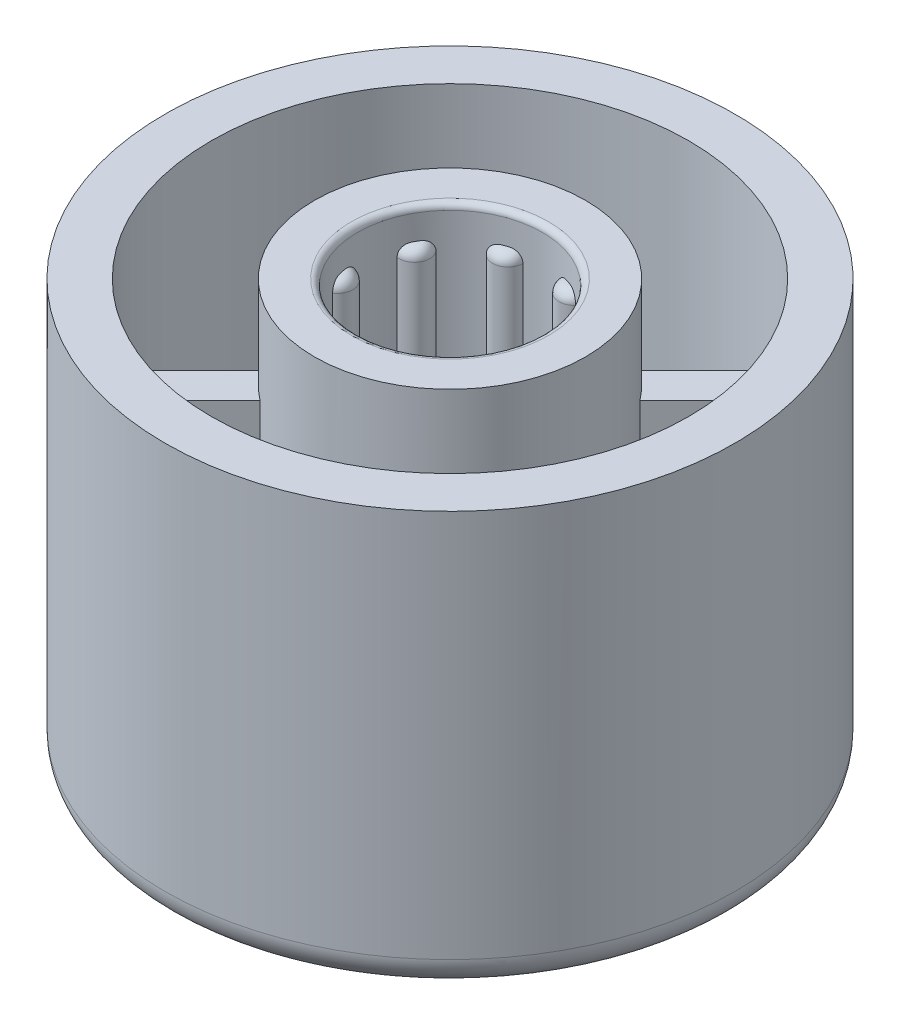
ISO-10303-21;
HEADER;
FILE_DESCRIPTION(('STEP AP214'),'2;1');
FILE_NAME('part.step','',(''),(''),'','','');
FILE_SCHEMA(('AUTOMOTIVE_DESIGN { 1 0 10303 214 1 1 1 1 }'));
ENDSEC;
DATA;
#1=APPLICATION_CONTEXT('core data for automotive mechanical design processes');
#2=APPLICATION_PROTOCOL_DEFINITION('international standard','automotive_design',2000,#1);
#3=PRODUCT_CONTEXT('',#1,'mechanical');
#4=PRODUCT('Part','Part','',(#3));
#5=PRODUCT_RELATED_PRODUCT_CATEGORY('part','',(#4));
#6=PRODUCT_DEFINITION_FORMATION('','',#4);
#7=PRODUCT_DEFINITION_CONTEXT('part definition',#1,'design');
#8=PRODUCT_DEFINITION('design','',#6,#7);
#9=PRODUCT_DEFINITION_SHAPE('','',#8);
#10=(LENGTH_UNIT() NAMED_UNIT(*) SI_UNIT(.MILLI.,.METRE.));
#11=(NAMED_UNIT(*) PLANE_ANGLE_UNIT() SI_UNIT($,.RADIAN.));
#12=(NAMED_UNIT(*) SI_UNIT($,.STERADIAN.) SOLID_ANGLE_UNIT());
#13=UNCERTAINTY_MEASURE_WITH_UNIT(LENGTH_MEASURE(1.E-05),#10,'distance_accuracy_value','');
#14=(GEOMETRIC_REPRESENTATION_CONTEXT(3) GLOBAL_UNCERTAINTY_ASSIGNED_CONTEXT((#13)) GLOBAL_UNIT_ASSIGNED_CONTEXT((#10,
#11,#12)) REPRESENTATION_CONTEXT('',''));
#15=CARTESIAN_POINT('',(0.,0.,0.));
#16=DIRECTION('',(0.,0.,1.));
#17=DIRECTION('',(1.,0.,0.));
#18=AXIS2_PLACEMENT_3D('',#15,#16,#17);
#19=CARTESIAN_POINT('',(0.939148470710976,-1.34,-3.04063336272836));
#20=DIRECTION('',(-0.503760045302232,0.,0.863843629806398));
#21=DIRECTION('',(-0.863843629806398,0.,-0.503760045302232));
#22=AXIS2_PLACEMENT_3D('',#19,#20,#21);
#23=CIRCLE('',#22,0.34);
#24=TRIMMED_CURVE('',#23,(PARAMETER_VALUE(-2.06075365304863)),
(PARAMETER_VALUE(2.06075365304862)),.T.,.PARAMETER.);
#25=CARTESIAN_POINT('',(1.07736345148,-1.34,-2.96003175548));
#26=DIRECTION('',(0.,1.,0.));
#27=AXIS1_PLACEMENT('',#25,#26);
#28=SURFACE_OF_REVOLUTION('',#24,#27);
#29=CARTESIAN_POINT('',(1.07736345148,-1.34,-2.96003175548));
#30=DIRECTION('',(0.,-1.,0.));
#31=DIRECTION('',(0.,0.,-1.));
#32=AXIS2_PLACEMENT_3D('',#29,#30,#31);
#33=CIRCLE('',#32,0.5);
#34=CARTESIAN_POINT('',(1.44979456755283,-1.34,-2.62642260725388));
#35=VERTEX_POINT('',#34);
#36=CARTESIAN_POINT('',(0.577624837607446,-1.34,-2.94386642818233));
#37=VERTEX_POINT('',#36);
#38=EDGE_CURVE('E302',#35,#37,#33,.T.);
#39=ORIENTED_EDGE('',*,*,#38,.F.);
#40=CARTESIAN_POINT('',(1.44979456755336,-1.34,-2.62642260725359));
#41=CARTESIAN_POINT('',(1.44980582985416,-1.32137724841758,-2.62641074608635));
#42=CARTESIAN_POINT('',(1.44842088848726,-1.3027587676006,-2.62718078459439));
#43=CARTESIAN_POINT('',(1.44294023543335,-1.26605653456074,-2.63019791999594));
#44=CARTESIAN_POINT('',(1.43884583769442,-1.24797252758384,-2.63244430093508));
#45=CARTESIAN_POINT('',(1.42802499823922,-1.21283739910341,-2.63832903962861));
#46=CARTESIAN_POINT('',(1.42129721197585,-1.19578681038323,-2.64196810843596));
#47=CARTESIAN_POINT('',(1.40537645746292,-1.16322066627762,-2.65047140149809));
#48=CARTESIAN_POINT('',(1.39618460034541,-1.14770442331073,-2.6553350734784));
#49=CARTESIAN_POINT('',(1.37557487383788,-1.11865263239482,-2.666069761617));
#50=CARTESIAN_POINT('',(1.36415968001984,-1.10511473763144,-2.6719395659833));
#51=CARTESIAN_POINT('',(1.33938035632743,-1.08034248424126,-2.68444646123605));
#52=CARTESIAN_POINT('',(1.32601368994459,-1.06911117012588,-2.69108454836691));
#53=CARTESIAN_POINT('',(1.29757320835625,-1.04913594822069,-2.70491320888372));
#54=CARTESIAN_POINT('',(1.28248427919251,-1.04041687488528,-2.71210846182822));
#55=CARTESIAN_POINT('',(1.25114831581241,-1.02571242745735,-2.72670628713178));
#56=CARTESIAN_POINT('',(1.23490200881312,-1.01972535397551,-2.73410872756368));
#57=CARTESIAN_POINT('',(1.19558755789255,-1.00866211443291,-2.75157834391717));
#58=CARTESIAN_POINT('',(1.17219797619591,-1.0047203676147,-2.76162971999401));
#59=CARTESIAN_POINT('',(1.12488982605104,-1.00038450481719,-2.78123846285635));
#60=CARTESIAN_POINT('',(1.10096942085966,-1.00000565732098,-2.79079352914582));
#61=CARTESIAN_POINT('',(1.06636011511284,-0.999997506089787,-2.80410500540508));
#62=CARTESIAN_POINT('',(1.05575178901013,-1.0000675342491,-2.80811625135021));
#63=CARTESIAN_POINT('',(1.03450429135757,-1.00014812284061,-2.81601297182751));
#64=CARTESIAN_POINT('',(1.0238651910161,-1.00015877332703,-2.81989862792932));
#65=CARTESIAN_POINT('',(1.00044559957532,-1.00009230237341,-2.82830204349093));
#66=CARTESIAN_POINT('',(0.987655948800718,-0.999997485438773,-2.83279361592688));
#67=CARTESIAN_POINT('',(0.96411507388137,-1.00000210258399,-2.84088198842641));
#68=CARTESIAN_POINT('',(0.953373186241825,-1.00007225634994,-2.8445048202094));
#69=CARTESIAN_POINT('',(0.931847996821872,-1.00060746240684,-2.85162905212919));
#70=CARTESIAN_POINT('',(0.921064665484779,-1.00107288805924,-2.8551303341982));
#71=CARTESIAN_POINT('',(0.888384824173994,-1.00344681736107,-2.86553623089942));
#72=CARTESIAN_POINT('',(0.866468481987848,-1.00634733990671,-2.87223633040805));
#73=CARTESIAN_POINT('',(0.823253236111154,-1.01595267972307,-2.8849192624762));
#74=CARTESIAN_POINT('',(0.801953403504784,-1.02265142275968,-2.89090322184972));
#75=CARTESIAN_POINT('',(0.764291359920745,-1.03868800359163,-2.90106442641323));
#76=CARTESIAN_POINT('',(0.747698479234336,-1.04739855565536,-2.90537651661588));
#77=CARTESIAN_POINT('',(0.716070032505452,-1.06757981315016,-2.91333311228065));
#78=CARTESIAN_POINT('',(0.701036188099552,-1.07905352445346,-2.91697688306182));
#79=CARTESIAN_POINT('',(0.673030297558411,-1.10450530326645,-2.92356601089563));
#80=CARTESIAN_POINT('',(0.660062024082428,-1.11848785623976,-2.92651009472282));
#81=CARTESIAN_POINT('',(0.636671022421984,-1.14852198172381,-2.93168787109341));
#82=CARTESIAN_POINT('',(0.62624434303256,-1.16457028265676,-2.93392266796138));
#83=CARTESIAN_POINT('',(0.608498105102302,-1.19780556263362,-2.93765387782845));
#84=CARTESIAN_POINT('',(0.601101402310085,-1.21494942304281,-2.93916880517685));
#85=CARTESIAN_POINT('',(0.58924201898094,-1.25025674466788,-2.94156945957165));
#86=CARTESIAN_POINT('',(0.584776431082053,-1.2684191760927,-2.94245581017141));
#87=CARTESIAN_POINT('',(0.580435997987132,-1.29561396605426,-2.94331373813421));
#88=CARTESIAN_POINT('',(0.579381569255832,-1.30446564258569,-2.94352131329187));
#89=CARTESIAN_POINT('',(0.577976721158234,-1.32221019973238,-2.94379741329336));
#90=CARTESIAN_POINT('',(0.577624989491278,-1.33110297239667,-2.94386619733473));
#91=CARTESIAN_POINT('',(0.577624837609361,-1.33999999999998,-2.94386642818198));
#92=B_SPLINE_CURVE_WITH_KNOTS('',3,(#40,#41,#42,#43,#44,#45,#46,#47,#48,#49,#50,#51,#52,#53,#54,
#55,#56,#57,#58,#59,#60,#61,#62,#63,#64,#65,#66,#67,#68,#69,#70,#71,#72,#73,#74,#75,#76,#77,#78,
#79,#80,#81,#82,#83,#84,#85,#86,#87,#88,#89,#90,#91),.UNSPECIFIED.,.F.,.F.,(4,2,2,2,2,2,2,2,2,2,
2,2,2,2,2,2,2,2,2,2,2,2,2,2,2,4),(0.,0.0557949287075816,0.111562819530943,0.167359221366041,
0.22313050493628,0.278835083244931,0.33461272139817,0.390924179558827,0.447200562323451,
0.524063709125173,0.60125609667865,0.635284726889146,0.6692617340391,0.709928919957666,
0.743933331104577,0.777969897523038,0.847023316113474,0.915966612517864,0.973400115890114,
1.03089638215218,1.08849648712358,1.14600646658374,1.20194436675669,1.25782669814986,
1.28455205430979,1.31122745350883),.UNSPECIFIED.);
#93=EDGE_CURVE('E310',#35,#37,#92,.T.);
#94=ORIENTED_EDGE('',*,*,#93,.T.);
#95=EDGE_LOOP('',(#39,#94));
#96=FACE_BOUND('',#95,.T.);
#97=ADVANCED_FACE('F17',(#96),#28,.F.);
#98=CARTESIAN_POINT('',(1.07736345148,-6.18999999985,-2.96003175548));
#99=DIRECTION('',(0.,-1.,0.));
#100=DIRECTION('',(0.,0.,-1.));
#101=AXIS2_PLACEMENT_3D('',#98,#99,#100);
#102=CYLINDRICAL_SURFACE('',#101,0.5);
#103=DIRECTION('',(0.,1.,0.));
#104=VECTOR('',#103,1.);
#105=CARTESIAN_POINT('',(1.4497945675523,-6.8,-2.62642260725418));
#106=LINE('',#105,#104);
#107=CARTESIAN_POINT('',(1.44979456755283,-13.6,-2.62642260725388));
#108=VERTEX_POINT('',#107);
#109=EDGE_CURVE('E331',#108,#35,#106,.T.);
#110=ORIENTED_EDGE('',*,*,#109,.T.);
#111=ORIENTED_EDGE('',*,*,#38,.T.);
#112=DIRECTION('',(0.,1.,0.));
#113=VECTOR('',#112,1.);
#114=CARTESIAN_POINT('',(0.57762483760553,-6.8,-2.9438664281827));
#115=LINE('',#114,#113);
#116=CARTESIAN_POINT('',(0.577624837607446,-13.6,-2.94386642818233));
#117=VERTEX_POINT('',#116);
#118=EDGE_CURVE('E306',#37,#117,#115,.F.);
#119=ORIENTED_EDGE('',*,*,#118,.T.);
#120=CARTESIAN_POINT('',(1.07736345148,-13.6,-2.96003175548));
#121=DIRECTION('',(0.,-1.,0.));
#122=DIRECTION('',(0.,0.,-1.));
#123=AXIS2_PLACEMENT_3D('',#120,#121,#122);
#124=CIRCLE('',#123,0.5);
#125=EDGE_CURVE('E291',#117,#108,#124,.F.);
#126=ORIENTED_EDGE('',*,*,#125,.T.);
#127=EDGE_LOOP('',(#110,#111,#119,#126));
#128=FACE_BOUND('',#127,.T.);
#129=ADVANCED_FACE('F307',(#128),#102,.T.);
#130=CARTESIAN_POINT('',(-1.21557843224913,-1.34,-3.04063336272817));
#131=DIRECTION('',(-0.503760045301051,0.,0.863843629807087));
#132=DIRECTION('',(-0.863843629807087,0.,-0.503760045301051));
#133=AXIS2_PLACEMENT_3D('',#130,#131,#132);
#134=CIRCLE('',#133,0.34);
#135=TRIMMED_CURVE('',#134,(PARAMETER_VALUE(-2.06075365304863)),
(PARAMETER_VALUE(2.06075365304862)),.T.,.PARAMETER.);
#136=CARTESIAN_POINT('',(-1.07736345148,-1.34,-2.96003175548));
#137=DIRECTION('',(0.,1.,0.));
#138=AXIS1_PLACEMENT('',#136,#137);
#139=SURFACE_OF_REVOLUTION('',#135,#138);
#140=CARTESIAN_POINT('',(-1.07736345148,-1.34,-2.96003175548));
#141=DIRECTION('',(0.,-1.,0.));
#142=DIRECTION('',(0.,0.,-1.));
#143=AXIS2_PLACEMENT_3D('',#140,#141,#142);
#144=CIRCLE('',#143,0.5);
#145=CARTESIAN_POINT('',(-0.577624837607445,-1.34,-2.94386642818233));
#146=VERTEX_POINT('',#145);
#147=CARTESIAN_POINT('',(-1.44979456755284,-1.33999999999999,-2.62642260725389));
#148=VERTEX_POINT('',#147);
#149=EDGE_CURVE('E822',#146,#148,#144,.T.);
#150=ORIENTED_EDGE('',*,*,#149,.F.);
#151=CARTESIAN_POINT('',(-0.577624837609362,-1.34,-2.94386642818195));
#152=CARTESIAN_POINT('',(-0.577608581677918,-1.32137511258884,-2.94386458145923));
#153=CARTESIAN_POINT('',(-0.579164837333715,-1.30275451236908,-2.94356417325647));
#154=CARTESIAN_POINT('',(-0.585303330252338,-1.26605240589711,-2.94235239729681));
#155=CARTESIAN_POINT('',(-0.589883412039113,-1.24797052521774,-2.94144146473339));
#156=CARTESIAN_POINT('',(-0.601953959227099,-1.21283926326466,-2.93899420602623));
#157=CARTESIAN_POINT('',(-0.609445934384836,-1.19579042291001,-2.93745755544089));
#158=CARTESIAN_POINT('',(-0.627107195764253,-1.16322397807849,-2.93373792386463));
#159=CARTESIAN_POINT('',(-0.637275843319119,-1.14770600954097,-2.93155509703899));
#160=CARTESIAN_POINT('',(-0.659971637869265,-1.11864422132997,-2.92652897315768));
#161=CARTESIAN_POINT('',(-0.67249706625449,-1.10509897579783,-2.92368615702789));
#162=CARTESIAN_POINT('',(-0.699520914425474,-1.08032961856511,-2.91733829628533));
#163=CARTESIAN_POINT('',(-0.714019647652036,-1.06910587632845,-2.91383314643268));
#164=CARTESIAN_POINT('',(-0.744683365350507,-1.04913688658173,-2.90614842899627));
#165=CARTESIAN_POINT('',(-0.76086358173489,-1.04041758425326,-2.90196245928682));
#166=CARTESIAN_POINT('',(-0.794254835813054,-1.02571574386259,-2.89300144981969));
#167=CARTESIAN_POINT('',(-0.811465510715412,-1.01973224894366,-2.88822661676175));
#168=CARTESIAN_POINT('',(-0.841538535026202,-1.01167160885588,-2.8795808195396));
#169=CARTESIAN_POINT('',(-0.854275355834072,-1.00897045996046,-2.87582902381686));
#170=CARTESIAN_POINT('',(-0.879877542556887,-1.00476163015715,-2.86809939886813));
#171=CARTESIAN_POINT('',(-0.892742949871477,-1.00325434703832,-2.86412149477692));
#172=CARTESIAN_POINT('',(-0.917168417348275,-1.0012791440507,-2.8563874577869));
#173=CARTESIAN_POINT('',(-0.928727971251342,-1.00072100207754,-2.8526500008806));
#174=CARTESIAN_POINT('',(-0.951811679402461,-1.0000818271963,-2.84503116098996));
#175=CARTESIAN_POINT('',(-0.963335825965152,-1.00000089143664,-2.8411497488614));
#176=CARTESIAN_POINT('',(-0.985555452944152,-0.999999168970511,-2.83351530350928));
#177=CARTESIAN_POINT('',(-0.996254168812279,-1.00006790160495,-2.8297713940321));
#178=CARTESIAN_POINT('',(-1.0176076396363,-1.0001476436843,-2.82216284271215));
#179=CARTESIAN_POINT('',(-1.02826239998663,-1.0001586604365,-2.81829821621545));
#180=CARTESIAN_POINT('',(-1.05161155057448,-1.00009246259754,-2.80967915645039));
#181=CARTESIAN_POINT('',(-1.06429624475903,-0.999997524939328,-2.80489882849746));
#182=CARTESIAN_POINT('',(-1.08752823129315,-1.0000020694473,-2.79596328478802));
#183=CARTESIAN_POINT('',(-1.09808513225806,-1.00007223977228,-2.79183400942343));
#184=CARTESIAN_POINT('',(-1.11915373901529,-1.00060742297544,-2.78345538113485));
#185=CARTESIAN_POINT('',(-1.12966538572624,-1.00107285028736,-2.77920590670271));
#186=CARTESIAN_POINT('',(-1.16138917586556,-1.00344682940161,-2.76617076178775));
#187=CARTESIAN_POINT('',(-1.18248504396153,-1.00634740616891,-2.75721567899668));
#188=CARTESIAN_POINT('',(-1.22374224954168,-1.0159528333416,-2.73915314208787));
#189=CARTESIAN_POINT('',(-1.24390504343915,-1.02265152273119,-2.73004595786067));
#190=CARTESIAN_POINT('',(-1.27928711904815,-1.03868800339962,-2.71362129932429));
#191=CARTESIAN_POINT('',(-1.29476976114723,-1.04739855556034,-2.70625885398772));
#192=CARTESIAN_POINT('',(-1.32411295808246,-1.06757981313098,-2.69202358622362));
#193=CARTESIAN_POINT('',(-1.33797172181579,-1.07905352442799,-2.68515130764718));
#194=CARTESIAN_POINT('',(-1.36366088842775,-1.10450530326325,-2.67219703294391));
#195=CARTESIAN_POINT('',(-1.37548758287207,-1.11848785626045,-2.66611648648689));
#196=CARTESIAN_POINT('',(-1.39673434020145,-1.1485219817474,-2.65504744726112));
#197=CARTESIAN_POINT('',(-1.40615813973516,-1.16457028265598,-2.6500572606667));
#198=CARTESIAN_POINT('',(-1.42215092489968,-1.19780556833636,-2.64150846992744));
#199=CARTESIAN_POINT('',(-1.42879090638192,-1.21494943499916,-2.63791446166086));
#200=CARTESIAN_POINT('',(-1.43941883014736,-1.25025675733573,-2.6321304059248));
#201=CARTESIAN_POINT('',(-1.44340940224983,-1.2684191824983,-2.62993896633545));
#202=CARTESIAN_POINT('',(-1.44728583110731,-1.29561396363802,-2.6278062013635));
#203=CARTESIAN_POINT('',(-1.44822699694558,-1.30446563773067,-2.62728743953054));
#204=CARTESIAN_POINT('',(-1.44948064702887,-1.32221019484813,-2.62659592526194));
#205=CARTESIAN_POINT('',(-1.44979430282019,-1.33110296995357,-2.62642252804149));
#206=CARTESIAN_POINT('',(-1.44979456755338,-1.33999999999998,-2.62642260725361));
#207=B_SPLINE_CURVE_WITH_KNOTS('',3,(#151,#152,#153,#154,#155,#156,#157,#158,#159,#160,#161,
#162,#163,#164,#165,#166,#167,#168,#169,#170,#171,#172,#173,#174,#175,#176,#177,#178,#179,#180,
#181,#182,#183,#184,#185,#186,#187,#188,#189,#190,#191,#192,#193,#194,#195,#196,#197,#198,#199,
#200,#201,#202,#203,#204,#205,#206),.UNSPECIFIED.,.F.,.F.,(4,2,2,2,2,2,2,2,2,2,2,2,2,2,2,2,2,2,
2,2,2,2,2,2,2,2,2,4),(0.,0.0558012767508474,0.111562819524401,0.167353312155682,
0.22313050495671,0.278867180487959,0.334612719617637,0.390916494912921,0.447200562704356,
0.487791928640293,0.528396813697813,0.564866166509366,0.601342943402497,0.635347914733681,
0.669348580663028,0.710015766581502,0.744018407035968,0.778056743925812,0.847110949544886,
0.916053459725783,0.973486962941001,1.03098322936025,1.08858333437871,1.14609331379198,
1.20203123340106,1.25791354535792,1.28463889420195,1.31131430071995),.UNSPECIFIED.);
#208=EDGE_CURVE('E320',#146,#148,#207,.T.);
#209=ORIENTED_EDGE('',*,*,#208,.T.);
#210=EDGE_LOOP('',(#150,#209));
#211=FACE_BOUND('',#210,.T.);
#212=ADVANCED_FACE('F821',(#211),#139,.F.);
#213=CARTESIAN_POINT('',(-1.07736345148,-6.18999999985,-2.96003175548));
#214=DIRECTION('',(0.,-1.,0.));
#215=DIRECTION('',(0.,0.,-1.));
#216=AXIS2_PLACEMENT_3D('',#213,#214,#215);
#217=CYLINDRICAL_SURFACE('',#216,0.5);
#218=DIRECTION('',(0.,1.,0.));
#219=VECTOR('',#218,1.);
#220=CARTESIAN_POINT('',(-0.577624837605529,-6.8,-2.9438664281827));
#221=LINE('',#220,#219);
#222=CARTESIAN_POINT('',(-0.577624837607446,-13.6,-2.94386642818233));
#223=VERTEX_POINT('',#222);
#224=EDGE_CURVE('E318',#223,#146,#221,.T.);
#225=ORIENTED_EDGE('',*,*,#224,.T.);
#226=ORIENTED_EDGE('',*,*,#149,.T.);
#227=DIRECTION('',(0.,1.,0.));
#228=VECTOR('',#227,1.);
#229=CARTESIAN_POINT('',(-1.4497945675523,-6.8,-2.62642260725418));
#230=LINE('',#229,#228);
#231=CARTESIAN_POINT('',(-1.44979456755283,-13.6,-2.62642260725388));
#232=VERTEX_POINT('',#231);
#233=EDGE_CURVE('E634',#148,#232,#230,.F.);
#234=ORIENTED_EDGE('',*,*,#233,.T.);
#235=CARTESIAN_POINT('',(-1.07736345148,-13.6,-2.96003175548));
#236=DIRECTION('',(0.,-1.,0.));
#237=DIRECTION('',(0.,0.,-1.));
#238=AXIS2_PLACEMENT_3D('',#235,#236,#237);
#239=CIRCLE('',#238,0.5);
#240=EDGE_CURVE('E828',#232,#223,#239,.F.);
#241=ORIENTED_EDGE('',*,*,#240,.T.);
#242=EDGE_LOOP('',(#225,#226,#234,#241));
#243=FACE_BOUND('',#242,.T.);
#244=ADVANCED_FACE('F825',(#243),#217,.T.);
#245=CARTESIAN_POINT('',(9.25,-1.,0.));
#246=DIRECTION('',(0.,1.,0.));
#247=DIRECTION('',(0.,0.,1.));
#248=AXIS2_PLACEMENT_3D('',#245,#246,#247);
#249=PLANE('',#248);
#250=CARTESIAN_POINT('',(-2.72798002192,-1.,-1.575));
#251=DIRECTION('',(0.,-1.,0.));
#252=DIRECTION('',(0.86602540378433,0.,0.500000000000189));
#253=AXIS2_PLACEMENT_3D('',#250,#251,#252);
#254=CIRCLE('',#253,0.16);
#255=CARTESIAN_POINT('',(-2.58941595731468,-1.,-1.49500000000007));
#256=VERTEX_POINT('',#255);
#257=CARTESIAN_POINT('',(-2.62481686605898,-1.,-1.45269970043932));
#258=VERTEX_POINT('',#257);
#259=EDGE_CURVE('E836',#256,#258,#254,.T.);
#260=ORIENTED_EDGE('',*,*,#259,.F.);
#261=CARTESIAN_POINT('',(-2.72798002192,-1.,-1.575));
#262=DIRECTION('',(0.,-1.,0.));
#263=DIRECTION('',(0.984354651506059,0.,0.176198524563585));
#264=AXIS2_PLACEMENT_3D('',#261,#262,#263);
#265=CIRCLE('',#264,0.159999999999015);
#266=CARTESIAN_POINT('',(-2.57048327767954,-1.,-1.54680823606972));
#267=VERTEX_POINT('',#266);
#268=EDGE_CURVE('E827',#256,#267,#265,.F.);
#269=ORIENTED_EDGE('',*,*,#268,.T.);
#270=CARTESIAN_POINT('',(0.,-1.,0.));
#271=DIRECTION('',(0.,1.,0.));
#272=DIRECTION('',(0.,0.,1.));
#273=AXIS2_PLACEMENT_3D('',#270,#271,#272);
#274=CIRCLE('',#273,3.);
#275=EDGE_CURVE('E1414',#267,#258,#274,.T.);
#276=ORIENTED_EDGE('',*,*,#275,.T.);
#277=EDGE_LOOP('',(#260,#269,#276));
#278=FACE_BOUND('',#277,.T.);
#279=ADVANCED_FACE('F802',(#278),#249,.T.);
#280=CARTESIAN_POINT('',(-2.86654408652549,-1.34,-1.65500000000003));
#281=DIRECTION('',(-0.50000000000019,0.,0.866025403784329));
#282=DIRECTION('',(-0.866025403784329,0.,-0.50000000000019));
#283=AXIS2_PLACEMENT_3D('',#280,#281,#282);
#284=CIRCLE('',#283,0.34);
#285=TRIMMED_CURVE('',#284,(PARAMETER_VALUE(-2.06075365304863)),
(PARAMETER_VALUE(2.06075365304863)),.T.,.PARAMETER.);
#286=CARTESIAN_POINT('',(-2.72798002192,-1.34,-1.575));
#287=DIRECTION('',(0.,1.,0.));
#288=AXIS1_PLACEMENT('',#286,#287);
#289=SURFACE_OF_REVOLUTION('',#285,#288);
#290=ORIENTED_EDGE('',*,*,#259,.T.);
#291=CARTESIAN_POINT('',(-2.62481686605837,-1.,-1.45269970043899));
#292=CARTESIAN_POINT('',(-2.63028728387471,-0.999998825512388,-1.44281531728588));
#293=CARTESIAN_POINT('',(-2.63570334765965,-1.00007089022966,-1.43289743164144));
#294=CARTESIAN_POINT('',(-2.64645827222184,-1.00060533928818,-1.41293612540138));
#295=CARTESIAN_POINT('',(-2.65179625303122,-1.00107063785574,-1.40289232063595));
#296=CARTESIAN_POINT('',(-2.66774990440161,-1.00344832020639,-1.37245663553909));
#297=CARTESIAN_POINT('',(-2.67816752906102,-1.00635506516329,-1.35200927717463));
#298=CARTESIAN_POINT('',(-2.69815995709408,-1.01597049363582,-1.3116541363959));
#299=CARTESIAN_POINT('',(-2.70773814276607,-1.02266302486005,-1.29174443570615));
#300=CARTESIAN_POINT('',(-2.72427290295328,-1.0386879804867,-1.25644466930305));
#301=CARTESIAN_POINT('',(-2.73140081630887,-1.04739853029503,-1.24085264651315));
#302=CARTESIAN_POINT('',(-2.74472877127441,-1.06757978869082,-1.21108632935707));
#303=CARTESIAN_POINT('',(-2.75092778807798,-1.07905350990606,-1.1969136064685));
#304=CARTESIAN_POINT('',(-2.76227998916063,-1.10450530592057,-1.17047736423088));
#305=CARTESIAN_POINT('',(-2.76743126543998,-1.11848786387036,-1.15821733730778));
#306=CARTESIAN_POINT('',(-2.77659218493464,-1.14852199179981,-1.13608080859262));
#307=CARTESIAN_POINT('',(-2.7806036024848,-1.16457028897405,-1.12620060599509));
#308=CARTESIAN_POINT('',(-2.787359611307,-1.19780499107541,-1.10937218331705));
#309=CARTESIAN_POINT('',(-2.7901358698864,-1.21494822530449,-1.10235111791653));
#310=CARTESIAN_POINT('',(-2.79455949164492,-1.25025547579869,-1.09108858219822));
#311=CARTESIAN_POINT('',(-2.79620789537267,-1.2684185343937,-1.08684454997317));
#312=CARTESIAN_POINT('',(-2.79780654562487,-1.29561413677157,-1.08271891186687));
#313=CARTESIAN_POINT('',(-2.79819407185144,-1.30446598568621,-1.08171653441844));
#314=CARTESIAN_POINT('',(-2.79870991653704,-1.32221054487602,-1.08038099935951));
#315=CARTESIAN_POINT('',(-2.79883872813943,-1.33110314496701,-1.08004656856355));
#316=CARTESIAN_POINT('',(-2.79883898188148,-1.33999999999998,-1.0800464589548));
#317=B_SPLINE_CURVE_WITH_KNOTS('',3,(#291,#292,#293,#294,#295,#296,#297,#298,#299,#300,#301,
#302,#303,#304,#305,#306,#307,#308,#309,#310,#311,#312,#313,#314,#315,#316),.UNSPECIFIED.,.F.,
.F.,(4,2,2,2,2,2,2,2,2,2,2,2,4),(0.,0.0338937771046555,0.0680409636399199,0.137185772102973,
0.206037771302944,0.263471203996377,0.32096754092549,0.378567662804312,0.436077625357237,
0.492013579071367,0.547897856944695,0.574623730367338,0.601298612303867),.UNSPECIFIED.);
#318=CARTESIAN_POINT('',(-2.79883898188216,-1.34,-1.08004645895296));
#319=VERTEX_POINT('',#318);
#320=EDGE_CURVE('E629',#258,#319,#317,.T.);
#321=ORIENTED_EDGE('',*,*,#320,.T.);
#322=CARTESIAN_POINT('',(-2.72798002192,-1.34,-1.575));
#323=DIRECTION('',(0.,-1.,0.));
#324=DIRECTION('',(0.,0.,-1.));
#325=AXIS2_PLACEMENT_3D('',#322,#323,#324);
#326=CIRCLE('',#325,0.5);
#327=CARTESIAN_POINT('',(-2.33476716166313,-1.34,-1.88384242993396));
#328=VERTEX_POINT('',#327);
#329=EDGE_CURVE('E787',#328,#319,#326,.T.);
#330=ORIENTED_EDGE('',*,*,#329,.F.);
#331=CARTESIAN_POINT('',(-2.33476716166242,-1.34,-1.88384242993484));
#332=CARTESIAN_POINT('',(-2.33475351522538,-1.32137015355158,-1.88385146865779));
#333=CARTESIAN_POINT('',(-2.33575311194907,-1.30274461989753,-1.88262034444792));
#334=CARTESIAN_POINT('',(-2.33967757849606,-1.26604279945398,-1.87774504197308));
#335=CARTESIAN_POINT('',(-2.34260005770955,-1.24796585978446,-1.87410385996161));
#336=CARTESIAN_POINT('',(-2.35027151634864,-1.21284397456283,-1.86447292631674));
#337=CARTESIAN_POINT('',(-2.35502143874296,-1.19579956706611,-1.85848196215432));
#338=CARTESIAN_POINT('',(-2.36615894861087,-1.16323230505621,-1.84428129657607));
#339=CARTESIAN_POINT('',(-2.37254702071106,-1.14770990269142,-1.83607093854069));
#340=CARTESIAN_POINT('',(-2.38670430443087,-1.11864393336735,-1.81762949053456));
#341=CARTESIAN_POINT('',(-2.39447216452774,-1.10509845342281,-1.8074003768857));
#342=CARTESIAN_POINT('',(-2.41109337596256,-1.08032918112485,-1.78516692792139));
#343=CARTESIAN_POINT('',(-2.41994685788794,-1.06910566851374,-1.77316237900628));
#344=CARTESIAN_POINT('',(-2.43847744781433,-1.04915763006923,-1.74759226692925));
#345=CARTESIAN_POINT('',(-2.44816054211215,-1.04045367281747,-1.73401505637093));
#346=CARTESIAN_POINT('',(-2.46797812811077,-1.02574062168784,-1.70569140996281));
#347=CARTESIAN_POINT('',(-2.47811419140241,-1.01974186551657,-1.69094073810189));
#348=CARTESIAN_POINT('',(-2.49527316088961,-1.01182911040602,-1.66546360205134));
#349=CARTESIAN_POINT('',(-2.50227470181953,-1.00922399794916,-1.65492712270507));
#350=CARTESIAN_POINT('',(-2.51624768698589,-1.00510269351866,-1.63360340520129));
#351=CARTESIAN_POINT('',(-2.52321907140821,-1.00358811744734,-1.62281581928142));
#352=CARTESIAN_POINT('',(-2.53699526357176,-1.00144803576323,-1.60119269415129));
#353=CARTESIAN_POINT('',(-2.54380099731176,-1.00081482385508,-1.59035841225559));
#354=CARTESIAN_POINT('',(-2.55725772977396,-1.00008729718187,-1.56862874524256));
#355=CARTESIAN_POINT('',(-2.56390920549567,-0.999991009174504,-1.55773373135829));
#356=CARTESIAN_POINT('',(-2.57048327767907,-1.,-1.54680823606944));
#357=B_SPLINE_CURVE_WITH_KNOTS('',3,(#331,#332,#333,#334,#335,#336,#337,#338,#339,#340,#341,
#342,#343,#344,#345,#346,#347,#348,#349,#350,#351,#352,#353,#354,#355,#356),.UNSPECIFIED.,.F.,
.F.,(4,2,2,2,2,2,2,2,2,2,2,2,4),(0.,0.055816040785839,0.111562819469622,0.167338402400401,
0.223130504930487,0.278868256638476,0.334612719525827,0.390800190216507,0.44720059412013,
0.485899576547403,0.524655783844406,0.563070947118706,0.601344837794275),.UNSPECIFIED.);
#358=EDGE_CURVE('E633',#328,#267,#357,.T.);
#359=ORIENTED_EDGE('',*,*,#358,.T.);
#360=ORIENTED_EDGE('',*,*,#268,.F.);
#361=EDGE_LOOP('',(#290,#321,#330,#359,#360));
#362=FACE_BOUND('',#361,.T.);
#363=ADVANCED_FACE('F798',(#362),#289,.F.);
#364=CARTESIAN_POINT('',(-2.72798002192,-6.18999999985,-1.575));
#365=DIRECTION('',(0.,-1.,0.));
#366=DIRECTION('',(0.,0.,-1.));
#367=AXIS2_PLACEMENT_3D('',#364,#365,#366);
#368=CYLINDRICAL_SURFACE('',#367,0.5);
#369=DIRECTION('',(0.,1.,0.));
#370=VECTOR('',#369,1.);
#371=CARTESIAN_POINT('',(-2.33476716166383,-6.8,-1.88384242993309));
#372=LINE('',#371,#370);
#373=CARTESIAN_POINT('',(-2.33476716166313,-13.6,-1.88384242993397));
#374=VERTEX_POINT('',#373);
#375=EDGE_CURVE('E630',#374,#328,#372,.T.);
#376=ORIENTED_EDGE('',*,*,#375,.T.);
#377=ORIENTED_EDGE('',*,*,#329,.T.);
#378=DIRECTION('',(0.,1.,0.));
#379=VECTOR('',#378,1.);
#380=CARTESIAN_POINT('',(-2.79883898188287,-6.8,-1.08004645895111));
#381=LINE('',#380,#379);
#382=CARTESIAN_POINT('',(-2.79883898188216,-13.6,-1.08004645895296));
#383=VERTEX_POINT('',#382);
#384=EDGE_CURVE('E626',#319,#383,#381,.F.);
#385=ORIENTED_EDGE('',*,*,#384,.T.);
#386=CARTESIAN_POINT('',(-2.72798002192,-13.6,-1.575));
#387=DIRECTION('',(0.,-1.,0.));
#388=DIRECTION('',(0.,0.,-1.));
#389=AXIS2_PLACEMENT_3D('',#386,#387,#388);
#390=CIRCLE('',#389,0.5);
#391=EDGE_CURVE('E791',#383,#374,#390,.F.);
#392=ORIENTED_EDGE('',*,*,#391,.T.);
#393=EDGE_LOOP('',(#376,#377,#385,#392));
#394=FACE_BOUND('',#393,.T.);
#395=ADVANCED_FACE('F781',(#394),#368,.T.);
#396=CARTESIAN_POINT('',(-3.08932977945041,-1.34,0.70647776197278));
#397=DIRECTION('',(0.996787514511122,0.,-0.0800915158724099));
#398=DIRECTION('',(0.0800915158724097,0.,0.996787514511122));
#399=AXIS2_PLACEMENT_3D('',#396,#397,#398);
#400=CIRCLE('',#399,0.34);
#401=TRIMMED_CURVE('',#400,(PARAMETER_VALUE(-2.06075365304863)),
(PARAMETER_VALUE(2.06075365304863)),.T.,.PARAMETER.);
#402=CARTESIAN_POINT('',(-3.10214442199,-1.34,0.546991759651));
#403=DIRECTION('',(0.,1.,0.));
#404=AXIS1_PLACEMENT('',#402,#403);
#405=SURFACE_OF_REVOLUTION('',#401,#404);
#406=CARTESIAN_POINT('',(-3.10214442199,-1.34,0.546991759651));
#407=DIRECTION('',(0.,-1.,0.));
#408=DIRECTION('',(0.,0.,-1.));
#409=AXIS2_PLACEMENT_3D('',#406,#407,#408);
#410=CIRCLE('',#409,0.5);
#411=CARTESIAN_POINT('',(-2.99944598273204,-1.34,0.0576523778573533));
#412=VERTEX_POINT('',#411);
#413=CARTESIAN_POINT('',(-2.83827553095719,-1.34,0.971695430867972));
#414=VERTEX_POINT('',#413);
#415=EDGE_CURVE('E786',#412,#414,#410,.T.);
#416=ORIENTED_EDGE('',*,*,#415,.F.);
#417=CARTESIAN_POINT('',(-2.99944598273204,-1.34,0.0576523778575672));
#418=CARTESIAN_POINT('',(-2.99944134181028,-1.32137724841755,0.0576366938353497));
#419=CARTESIAN_POINT('',(-2.99941574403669,-1.30275876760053,0.0592211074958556));
#420=CARTESIAN_POINT('',(-2.99928833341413,-1.2660565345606,0.0654760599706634));
#421=CARTESIAN_POINT('',(-2.99918655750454,-1.24797252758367,0.0701451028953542));
#422=CARTESIAN_POINT('',(-2.99887247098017,-1.21283739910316,0.0824585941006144));
#423=CARTESIAN_POINT('',(-2.99866010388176,-1.19578681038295,0.0901045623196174));
#424=CARTESIAN_POINT('',(-2.99806379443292,-1.16322066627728,0.108143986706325));
#425=CARTESIAN_POINT('',(-2.99767992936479,-1.14770442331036,0.118536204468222));
#426=CARTESIAN_POINT('',(-2.99667157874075,-1.1186526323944,0.141752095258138));
#427=CARTESIAN_POINT('',(-2.99604738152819,-1.10511473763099,0.154572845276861));
#428=CARTESIAN_POINT('',(-2.99448900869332,-1.08034248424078,0.182285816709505));
#429=CARTESIAN_POINT('',(-2.99355442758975,-1.06911117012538,0.197180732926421));
#430=CARTESIAN_POINT('',(-2.99131015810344,-1.04913594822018,0.228725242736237));
#431=CARTESIAN_POINT('',(-2.98999696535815,-1.04041687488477,0.245390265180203));
#432=CARTESIAN_POINT('',(-2.98697107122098,-1.02571242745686,0.279826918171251));
#433=CARTESIAN_POINT('',(-2.98525861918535,-1.01972535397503,0.297597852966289));
#434=CARTESIAN_POINT('',(-2.98073052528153,-1.00866211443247,0.340379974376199));
#435=CARTESIAN_POINT('',(-2.97774048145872,-1.00472036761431,0.365661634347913));
#436=CARTESIAN_POINT('',(-2.9710680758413,-1.00038450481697,0.416436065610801));
#437=CARTESIAN_POINT('',(-2.9673828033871,-1.00000565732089,0.441929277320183));
#438=CARTESIAN_POINT('',(-2.96160622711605,-0.999997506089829,0.47855755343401));
#439=CARTESIAN_POINT('',(-2.959775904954,-1.00006753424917,0.489750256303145));
#440=CARTESIAN_POINT('',(-2.95599091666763,-1.00014812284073,0.51209948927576));
#441=CARTESIAN_POINT('',(-2.95403644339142,-1.00015877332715,0.523256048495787));
#442=CARTESIAN_POINT('',(-2.94960421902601,-1.00009230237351,0.54773971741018));
#443=CARTESIAN_POINT('',(-2.94709920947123,-0.999997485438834,0.561061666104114));
#444=CARTESIAN_POINT('',(-2.9423335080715,-1.00000210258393,0.585492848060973));
#445=CARTESIAN_POINT('',(-2.94010002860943,-1.00007225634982,0.596607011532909));
#446=CARTESIAN_POINT('',(-2.93550719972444,-1.00060746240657,0.618810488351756));
#447=CARTESIAN_POINT('',(-2.93314773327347,-1.00107288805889,0.629899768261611));
#448=CARTESIAN_POINT('',(-2.92581958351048,-1.00344681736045,0.663404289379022));
#449=CARTESIAN_POINT('',(-2.92066386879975,-1.00634733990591,0.685734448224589));
#450=CARTESIAN_POINT('',(-2.91003998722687,-1.01595267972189,0.729501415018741));
#451=CARTESIAN_POINT('',(-2.90457233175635,-1.02265142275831,0.750939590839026));
#452=CARTESIAN_POINT('',(-2.89454117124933,-1.03868800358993,0.788636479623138));
#453=CARTESIAN_POINT('',(-2.889979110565,-1.04739855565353,0.805162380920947));
#454=CARTESIAN_POINT('',(-2.88105550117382,-1.06757981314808,0.83653171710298));
#455=CARTESIAN_POINT('',(-2.8766941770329,-1.07905352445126,0.851373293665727));
#456=CARTESIAN_POINT('',(-2.86839758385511,-1.10450530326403,0.878921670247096));
#457=CARTESIAN_POINT('',(-2.86446309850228,-1.11848785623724,0.891624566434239));
#458=CARTESIAN_POINT('',(-2.85725168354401,-1.14852198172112,0.914470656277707));
#459=CARTESIAN_POINT('',(-2.85397373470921,-1.16457028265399,0.92461782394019));
#460=CARTESIAN_POINT('',(-2.8483319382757,-1.19780556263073,0.941852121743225));
#461=CARTESIAN_POINT('',(-2.84594555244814,-1.21494942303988,0.949015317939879));
#462=CARTESIAN_POINT('',(-2.84209488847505,-1.25025674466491,0.960486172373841));
#463=CARTESIAN_POINT('',(-2.8406296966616,-1.26841917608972,0.964796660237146));
#464=CARTESIAN_POINT('',(-2.83920246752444,-1.29561396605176,0.968984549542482));
#465=CARTESIAN_POINT('',(-2.83885501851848,-1.30446564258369,0.970001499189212));
#466=CARTESIAN_POINT('',(-2.83839170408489,-1.32221019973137,0.971356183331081));
#467=CARTESIAN_POINT('',(-2.83827540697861,-1.33110297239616,0.971695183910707));
#468=CARTESIAN_POINT('',(-2.83827553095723,-1.33999999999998,0.971695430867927));
#469=B_SPLINE_CURVE_WITH_KNOTS('',3,(#417,#418,#419,#420,#421,#422,#423,#424,#425,#426,#427,
#428,#429,#430,#431,#432,#433,#434,#435,#436,#437,#438,#439,#440,#441,#442,#443,#444,#445,#446,
#447,#448,#449,#450,#451,#452,#453,#454,#455,#456,#457,#458,#459,#460,#461,#462,#463,#464,#465,
#466,#467,#468),.UNSPECIFIED.,.F.,.F.,(4,2,2,2,2,2,2,2,2,2,2,2,2,2,2,2,2,2,2,2,2,2,2,2,2,4),(0.,
0.0557949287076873,0.111562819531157,0.167359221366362,0.223130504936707,0.278835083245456,
0.334612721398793,0.390924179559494,0.447200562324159,0.524063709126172,0.601256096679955,
0.635284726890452,0.669261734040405,0.709928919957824,0.743933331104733,0.777969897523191,
0.847023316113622,0.915966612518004,0.973400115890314,1.03089638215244,1.0884964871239,
1.14600646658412,1.20194436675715,1.25782669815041,1.28455205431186,1.3112274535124),.UNSPECIFIED.);
#470=EDGE_CURVE('E356',#412,#414,#469,.T.);
#471=ORIENTED_EDGE('',*,*,#470,.T.);
#472=EDGE_LOOP('',(#416,#471));
#473=FACE_BOUND('',#472,.T.);
#474=ADVANCED_FACE('F776',(#473),#405,.F.);
#475=CARTESIAN_POINT('',(-3.10214442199,-6.18999999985,0.546991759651));
#476=DIRECTION('',(0.,-1.,0.));
#477=DIRECTION('',(0.,0.,-1.));
#478=AXIS2_PLACEMENT_3D('',#475,#476,#477);
#479=CYLINDRICAL_SURFACE('',#478,0.5);
#480=DIRECTION('',(0.,1.,0.));
#481=VECTOR('',#480,1.);
#482=CARTESIAN_POINT('',(-2.99944598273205,-6.8,0.0576523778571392));
#483=LINE('',#482,#481);
#484=CARTESIAN_POINT('',(-2.99944598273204,-13.6,0.0576523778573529));
#485=VERTEX_POINT('',#484);
#486=EDGE_CURVE('E618',#485,#412,#483,.T.);
#487=ORIENTED_EDGE('',*,*,#486,.T.);
#488=ORIENTED_EDGE('',*,*,#415,.T.);
#489=DIRECTION('',(0.,1.,0.));
#490=VECTOR('',#489,1.);
#491=CARTESIAN_POINT('',(-2.83827553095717,-6.8,0.97169543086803));
#492=LINE('',#491,#490);
#493=CARTESIAN_POINT('',(-2.83827553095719,-13.6,0.971695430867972));
#494=VERTEX_POINT('',#493);
#495=EDGE_CURVE('E609',#414,#494,#492,.F.);
#496=ORIENTED_EDGE('',*,*,#495,.T.);
#497=CARTESIAN_POINT('',(-3.10214442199,-13.6,0.546991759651));
#498=DIRECTION('',(0.,-1.,0.));
#499=DIRECTION('',(0.,0.,-1.));
#500=AXIS2_PLACEMENT_3D('',#497,#498,#499);
#501=CIRCLE('',#500,0.5);
#502=EDGE_CURVE('E790',#494,#485,#501,.F.);
#503=ORIENTED_EDGE('',*,*,#502,.T.);
#504=EDGE_LOOP('',(#487,#488,#496,#503));
#505=FACE_BOUND('',#504,.T.);
#506=ADVANCED_FACE('F774',(#505),#479,.T.);
#507=CARTESIAN_POINT('',(9.25,-1.,0.));
#508=DIRECTION('',(0.,1.,0.));
#509=DIRECTION('',(0.,0.,1.));
#510=AXIS2_PLACEMENT_3D('',#507,#508,#509);
#511=PLANE('',#510);
#512=CARTESIAN_POINT('',(2.72798002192,-1.,-1.575));
#513=DIRECTION('',(0.,-1.,0.));
#514=DIRECTION('',(-0.866025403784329,0.,0.500000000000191));
#515=AXIS2_PLACEMENT_3D('',#512,#513,#514);
#516=CIRCLE('',#515,0.16);
#517=CARTESIAN_POINT('',(2.57048327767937,-1.,-1.54680823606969));
#518=VERTEX_POINT('',#517);
#519=CARTESIAN_POINT('',(2.58941595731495,-1.,-1.49500000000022));
#520=VERTEX_POINT('',#519);
#521=EDGE_CURVE('E740',#518,#520,#516,.F.);
#522=ORIENTED_EDGE('',*,*,#521,.T.);
#523=CARTESIAN_POINT('',(2.72798002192,-1.,-1.575));
#524=DIRECTION('',(0.,-1.,0.));
#525=DIRECTION('',(-0.644769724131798,0.,0.764376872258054));
#526=AXIS2_PLACEMENT_3D('',#523,#524,#525);
#527=CIRCLE('',#526,0.159999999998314);
#528=CARTESIAN_POINT('',(2.62481686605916,-1.,-1.45269970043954));
#529=VERTEX_POINT('',#528);
#530=EDGE_CURVE('E522',#529,#520,#527,.T.);
#531=ORIENTED_EDGE('',*,*,#530,.F.);
#532=CARTESIAN_POINT('',(0.,-1.,0.));
#533=DIRECTION('',(0.,1.,0.));
#534=DIRECTION('',(0.,0.,1.));
#535=AXIS2_PLACEMENT_3D('',#532,#533,#534);
#536=CIRCLE('',#535,3.);
#537=EDGE_CURVE('E972',#529,#518,#536,.T.);
#538=ORIENTED_EDGE('',*,*,#537,.T.);
#539=EDGE_LOOP('',(#522,#531,#538));
#540=FACE_BOUND('',#539,.T.);
#541=ADVANCED_FACE('F714',(#540),#511,.T.);
#542=CARTESIAN_POINT('',(9.25,0.,0.));
#543=DIRECTION('',(0.,1.,0.));
#544=DIRECTION('',(0.,0.,1.));
#545=AXIS2_PLACEMENT_3D('',#542,#543,#544);
#546=PLANE('',#545);
#547=CARTESIAN_POINT('',(0.,0.,0.));
#548=DIRECTION('',(0.,1.,0.));
#549=DIRECTION('',(0.,0.,1.));
#550=AXIS2_PLACEMENT_3D('',#547,#548,#549);
#551=CIRCLE('',#550,4.4);
#552=CARTESIAN_POINT('',(0.,0.,4.4));
#553=VERTEX_POINT('',#552);
#554=EDGE_CURVE('E977',#553,#553,#551,.F.);
#555=ORIENTED_EDGE('',*,*,#554,.F.);
#556=EDGE_LOOP('',(#555));
#557=FACE_BOUND('',#556,.T.);
#558=CARTESIAN_POINT('',(2.80826419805,0.,-1.53416172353));
#559=CARTESIAN_POINT('',(2.78316248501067,0.,-1.58011241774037));
#560=CARTESIAN_POINT('',(2.75693111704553,0.,-1.62544587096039));
#561=CARTESIAN_POINT('',(2.7022764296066,0.,-1.71477163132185));
#562=CARTESIAN_POINT('',(2.67385311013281,0.,-1.75876393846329));
#563=CARTESIAN_POINT('',(2.61488187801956,0.,-1.84530074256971));
#564=CARTESIAN_POINT('',(2.5843339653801,0.,-1.8878452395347));
#565=CARTESIAN_POINT('',(2.52118743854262,0.,-1.97138411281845));
#566=CARTESIAN_POINT('',(2.48858882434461,0.,-2.01237848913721));
#567=CARTESIAN_POINT('',(2.42141934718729,0.,-2.09271831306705));
#568=CARTESIAN_POINT('',(2.38684848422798,0.,-2.13206376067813));
#569=CARTESIAN_POINT('',(2.3158178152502,0.,-2.20901095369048));
#570=CARTESIAN_POINT('',(2.27935800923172,0.,-2.24661269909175));
#571=CARTESIAN_POINT('',(2.20463728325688,0.,-2.31998189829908));
#572=CARTESIAN_POINT('',(2.16637636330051,0.,-2.35574935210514));
#573=CARTESIAN_POINT('',(2.08814558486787,0.,-2.4253638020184));
#574=CARTESIAN_POINT('',(2.04817572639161,0.,-2.4592107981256));
#575=CARTESIAN_POINT('',(1.96662336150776,0.,-2.52490279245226));
#576=CARTESIAN_POINT('',(1.92504085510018,0.,-2.55674779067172));
#577=CARTESIAN_POINT('',(1.8403633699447,0.,-2.61835907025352));
#578=CARTESIAN_POINT('',(1.79726839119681,-2.77171736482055E-13,-2.64812535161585));
#579=CARTESIAN_POINT('',(1.70966978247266,2.77171736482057E-13,-2.70550749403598));
#580=CARTESIAN_POINT('',(1.66516615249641,1.03441900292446E-12,-2.73312335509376));
#581=CARTESIAN_POINT('',(1.57485744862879,-1.03441900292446E-12,-2.78613810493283));
#582=CARTESIAN_POINT('',(1.52905237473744,-3.8605042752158E-12,-2.81153699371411));
#583=CARTESIAN_POINT('',(1.43625115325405,3.86050427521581E-12,-2.86005669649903));
#584=CARTESIAN_POINT('',(1.38925500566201,1.44075980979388E-11,-2.88317751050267));
#585=CARTESIAN_POINT('',(1.2941847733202,-1.44075980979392E-11,-2.92708504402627));
#586=CARTESIAN_POINT('',(1.24611068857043,-5.37698881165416E-11,-2.94787176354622));
#587=CARTESIAN_POINT('',(1.14900069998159,5.37698881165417E-11,-2.98706222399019));
#588=CARTESIAN_POINT('',(1.09996479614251,2.00671954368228E-10,-3.00546596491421));
#589=CARTESIAN_POINT('',(1.00104816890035,-2.00671954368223E-10,-3.03984167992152));
#590=CARTESIAN_POINT('',(0.951167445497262,-7.4891792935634E-10,-3.05581365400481));
#591=CARTESIAN_POINT('',(0.84863872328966,7.79429334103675E-10,-3.08590470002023));
#592=CARTESIAN_POINT('',(0.795960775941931,2.96387021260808E-09,-3.09992177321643));
#593=CARTESIAN_POINT('',(0.68997152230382,-1.26533088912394E-08,-3.125279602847));
#594=CARTESIAN_POINT('',(0.636660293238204,-3.04525162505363E-08,-3.13662068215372));
#595=CARTESIAN_POINT('',(0.529537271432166,-1.24589203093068E-07,-3.1565892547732));
#596=CARTESIAN_POINT('',(0.475725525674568,-2.00921241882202E-07,-3.16521700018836));
#597=CARTESIAN_POINT('',(0.367740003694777,-5.83986923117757E-07,-3.17975813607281));
#598=CARTESIAN_POINT('',(0.313566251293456,-8.90705550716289E-07,-3.18567170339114));
#599=CARTESIAN_POINT('',(0.204975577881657,-1.59008209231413E-06,-3.1947004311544));
#600=CARTESIAN_POINT('',(0.150558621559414,-1.98275291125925E-06,-3.19781517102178));
#601=CARTESIAN_POINT('',(0.0416599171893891,-2.29152694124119E-06,-3.20114761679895));
#602=CARTESIAN_POINT('',(-0.0128217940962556,-2.20783002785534E-06,-3.20136653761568));
#603=CARTESIAN_POINT('',(-0.121698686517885,-1.6695860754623E-06,-3.1989811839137));
#604=CARTESIAN_POINT('',(-0.176093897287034,-1.21522434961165E-06,-3.19637831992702));
#605=CARTESIAN_POINT('',(-0.284622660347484,-4.23232091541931E-07,-3.18816524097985));
#606=CARTESIAN_POINT('',(-0.338756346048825,-8.55340392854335E-08,-3.18255677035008));
#607=CARTESIAN_POINT('',(-0.421431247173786,4.54635042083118E-08,-3.17222087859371));
#608=CARTESIAN_POINT('',(-0.450081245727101,1.96858524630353E-08,-3.16831159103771));
#609=CARTESIAN_POINT('',(-0.549999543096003,-5.25791878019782E-08,-3.15330141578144));
#610=CARTESIAN_POINT('',(-0.62098152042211,-7.24568706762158E-08,-3.14018301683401));
#611=CARTESIAN_POINT('',(-0.745104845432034,-2.63856773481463E-07,-3.11287442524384));
#612=CARTESIAN_POINT('',(-0.798470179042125,-3.98147697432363E-07,-3.0996830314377));
#613=CARTESIAN_POINT('',(-0.894983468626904,-5.78248067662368E-07,-3.07313032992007));
#614=CARTESIAN_POINT('',(-0.938255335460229,-6.35570587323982E-07,-3.06021941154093));
#615=CARTESIAN_POINT('',(-1.02906699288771,-6.74747690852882E-07,-3.03098532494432));
#616=CARTESIAN_POINT('',(-1.07653585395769,-6.47331764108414E-07,-3.01444137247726));
#617=CARTESIAN_POINT('',(-1.17062795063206,-5.48196127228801E-07,-2.97911965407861));
#618=CARTESIAN_POINT('',(-1.21725128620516,-4.76481690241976E-07,-2.9603421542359));
#619=CARTESIAN_POINT('',(-1.30954708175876,-3.08487719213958E-07,-2.92059603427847));
#620=CARTESIAN_POINT('',(-1.35521967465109,-2.12211644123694E-07,-2.89962772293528));
#621=CARTESIAN_POINT('',(-1.44550356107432,-5.9775421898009E-08,-2.85553694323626));
#622=CARTESIAN_POINT('',(-1.49011502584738,-3.60875896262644E-09,-2.83241482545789));
#623=CARTESIAN_POINT('',(-1.57826999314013,3.61380626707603E-09,-2.78407981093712));
#624=CARTESIAN_POINT('',(-1.62181191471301,-4.547741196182E-08,-2.75886403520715));
#625=CARTESIAN_POINT('',(-1.70769192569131,-9.85161164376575E-08,-2.70648681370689));
#626=CARTESIAN_POINT('',(-1.75003038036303,-1.02477449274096E-07,-2.67932596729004));
#627=CARTESIAN_POINT('',(-1.83338968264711,2.7059390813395E-09,-2.62307769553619));
#628=CARTESIAN_POINT('',(-1.87441084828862,1.11823145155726E-07,-2.59399074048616));
#629=CARTESIAN_POINT('',(-1.95513410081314,-1.48238180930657E-07,-2.53404695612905));
#630=CARTESIAN_POINT('',(-1.99483642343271,-5.1733075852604E-07,-2.5031904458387));
#631=CARTESIAN_POINT('',(-2.05769127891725,-7.32951858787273E-07,-2.45161530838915));
#632=CARTESIAN_POINT('',(-2.0813664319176,-7.25342789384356E-07,-2.43153244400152));
#633=CARTESIAN_POINT('',(-2.12714583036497,-6.37943817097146E-07,-2.39151603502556));
#634=CARTESIAN_POINT('',(-2.14927459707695,-5.61143161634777E-07,-2.37161047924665));
#635=CARTESIAN_POINT('',(-2.1999315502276,-3.93369809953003E-07,-2.32473786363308));
#636=CARTESIAN_POINT('',(-2.22824989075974,-3.05688906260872E-07,-2.29754336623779));
#637=CARTESIAN_POINT('',(-2.28138655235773,-1.67563819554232E-07,-2.24460024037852));
#638=CARTESIAN_POINT('',(-2.30629185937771,-1.14497202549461E-07,-2.21893879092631));
#639=CARTESIAN_POINT('',(-2.3504292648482,-4.75754077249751E-08,-2.17191611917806));
#640=CARTESIAN_POINT('',(-2.36981549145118,-2.8068641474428E-08,-2.15069935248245));
#641=CARTESIAN_POINT('',(-2.4131228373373,-2.37599041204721E-09,-2.10201230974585));
#642=CARTESIAN_POINT('',(-2.43687002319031,-1.14850530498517E-09,-2.07438724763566));
#643=CARTESIAN_POINT('',(-2.49498455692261,1.71819931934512E-09,-2.00446631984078));
#644=CARTESIAN_POINT('',(-2.52877691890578,3.25963329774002E-09,-1.96169033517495));
#645=CARTESIAN_POINT('',(-2.59414686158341,-6.21767542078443E-09,-1.87448935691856));
#646=CARTESIAN_POINT('',(-2.62572476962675,-1.72345575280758E-08,-1.83006460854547));
#647=CARTESIAN_POINT('',(-2.68659514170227,-9.55927744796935E-08,-1.73968367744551));
#648=CARTESIAN_POINT('',(-2.71588787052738,-1.62927572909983E-07,-1.69372767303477));
#649=CARTESIAN_POINT('',(-2.77212971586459,-5.50288070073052E-07,-1.60040835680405));
#650=CARTESIAN_POINT('',(-2.79907902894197,-8.70292552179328E-07,-1.55304516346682));
#651=CARTESIAN_POINT('',(-2.85050877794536,-1.62705374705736E-06,-1.45698007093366));
#652=CARTESIAN_POINT('',(-2.87498864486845,-2.06383728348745E-06,-1.40827786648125));
#653=CARTESIAN_POINT('',(-2.92130898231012,-2.42528668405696E-06,-1.3096614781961));
#654=CARTESIAN_POINT('',(-2.94315061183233,-2.35017826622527E-06,-1.25974783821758));
#655=CARTESIAN_POINT('',(-2.98420526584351,-1.79077302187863E-06,-1.1588783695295));
#656=CARTESIAN_POINT('',(-3.00341966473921,-1.30669110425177E-06,-1.10792310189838));
#657=CARTESIAN_POINT('',(-3.03897422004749,-4.58849485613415E-07,-1.00505825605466));
#658=CARTESIAN_POINT('',(-3.0553161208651,-9.5016640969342E-08,-0.953149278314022));
#659=CARTESIAN_POINT('',(-3.07948080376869,5.56160509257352E-08,-0.870359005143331));
#660=CARTESIAN_POINT('',(-3.08802619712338,1.91327882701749E-08,-0.839683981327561));
#661=CARTESIAN_POINT('',(-3.10452727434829,-2.57622033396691E-08,-0.776846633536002));
#662=CARTESIAN_POINT('',(-3.11244517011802,-3.29798987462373E-08,-0.744674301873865));
#663=CARTESIAN_POINT('',(-3.12985844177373,-1.17696394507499E-07,-0.668918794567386));
#664=CARTESIAN_POINT('',(-3.13895054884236,-2.18668084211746E-07,-0.625242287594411));
#665=CARTESIAN_POINT('',(-3.15279994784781,-4.4557032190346E-07,-0.550937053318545));
#666=CARTESIAN_POINT('',(-3.15803317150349,-5.54467459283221E-07,-0.5203961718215));
#667=CARTESIAN_POINT('',(-3.16719968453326,-7.63746191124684E-07,-0.461735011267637));
#668=CARTESIAN_POINT('',(-3.17120509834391,-8.64078042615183E-07,-0.433625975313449));
#669=CARTESIAN_POINT('',(-3.18108532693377,-1.09974660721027E-06,-0.356866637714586));
#670=CARTESIAN_POINT('',(-3.18620647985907,-1.20762304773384E-06,-0.308117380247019));
#671=CARTESIAN_POINT('',(-3.19460808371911,-1.27675832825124E-06,-0.204993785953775));
#672=CARTESIAN_POINT('',(-3.19762006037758,-1.22035285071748E-06,-0.150597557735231));
#673=CARTESIAN_POINT('',(-3.20083137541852,-1.02888672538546E-06,-0.0417331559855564));
#674=CARTESIAN_POINT('',(-3.20103123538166,-8.93840668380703E-07,0.0127350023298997));
#675=CARTESIAN_POINT('',(-3.1986431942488,-5.75469140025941E-07,0.121599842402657));
#676=CARTESIAN_POINT('',(-3.19605589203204,-3.92154046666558E-07,0.175996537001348));
#677=CARTESIAN_POINT('',(-3.18798990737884,-1.15141845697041E-07,0.284561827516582));
#678=CARTESIAN_POINT('',(-3.18251193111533,-2.14228660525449E-08,0.338730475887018));
#679=CARTESIAN_POINT('',(-3.1727161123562,9.88041012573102E-09,0.417647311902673));
#680=CARTESIAN_POINT('',(-3.16936343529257,4.38246989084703E-09,0.442522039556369));
#681=CARTESIAN_POINT('',(-3.15675025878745,-1.93522782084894E-08,0.528481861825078));
#682=CARTESIAN_POINT('',(-3.14601612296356,-4.44639627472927E-08,0.589362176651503));
#683=CARTESIAN_POINT('',(-3.12681618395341,-1.56744436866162E-07,0.682459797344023));
#684=CARTESIAN_POINT('',(-3.11958929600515,-2.0993032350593E-07,0.714940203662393));
#685=CARTESIAN_POINT('',(-3.10464231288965,-3.24224038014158E-07,0.777478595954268));
#686=CARTESIAN_POINT('',(-3.09698827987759,-3.84556419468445E-07,0.807552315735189));
#687=CARTESIAN_POINT('',(-3.07579727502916,-5.22608116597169E-07,0.885962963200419));
#688=CARTESIAN_POINT('',(-3.06154638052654,-5.88054566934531E-07,0.934108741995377));
#689=CARTESIAN_POINT('',(-3.03077204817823,-6.51913933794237E-07,1.02966458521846));
#690=CARTESIAN_POINT('',(-3.01424870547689,-6.50329655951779E-07,1.07707468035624));
#691=CARTESIAN_POINT('',(-2.97896618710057,-5.79976958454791E-07,1.17105231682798));
#692=CARTESIAN_POINT('',(-2.96020716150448,-5.11213046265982E-07,1.21761991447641));
#693=CARTESIAN_POINT('',(-2.92049676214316,-3.3915826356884E-07,1.30980555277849));
#694=CARTESIAN_POINT('',(-2.89954559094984,-2.35870581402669E-07,1.35542368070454));
#695=CARTESIAN_POINT('',(-2.85550031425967,-6.93084486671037E-08,1.44560674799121));
#696=CARTESIAN_POINT('',(-2.83240646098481,-6.02929540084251E-09,1.49017181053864));
#697=CARTESIAN_POINT('',(-2.80826421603,0.,1.53416169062));
#698=B_SPLINE_CURVE_WITH_KNOTS('',3,(#558,#559,#560,#561,#562,#563,#564,#565,#566,#567,#568,
#569,#570,#571,#572,#573,#574,#575,#576,#577,#578,#579,#580,#581,#582,#583,#584,#585,#586,#587,
#588,#589,#590,#591,#592,#593,#594,#595,#596,#597,#598,#599,#600,#601,#602,#603,#604,#605,#606,
#607,#608,#609,#610,#611,#612,#613,#614,#615,#616,#617,#618,#619,#620,#621,#622,#623,#624,#625,
#626,#627,#628,#629,#630,#631,#632,#633,#634,#635,#636,#637,#638,#639,#640,#641,#642,#643,#644,
#645,#646,#647,#648,#649,#650,#651,#652,#653,#654,#655,#656,#657,#658,#659,#660,#661,#662,#663,
#664,#665,#666,#667,#668,#669,#670,#671,#672,#673,#674,#675,#676,#677,#678,#679,#680,#681,#682,
#683,#684,#685,#686,#687,#688,#689,#690,#691,#692,#693,#694,#695,#696,#697),.UNSPECIFIED.,.F.,
.F.,(4,2,2,2,2,2,2,2,2,2,2,2,2,2,2,2,2,2,2,2,2,2,2,2,2,2,2,2,2,2,2,2,2,2,2,2,2,2,2,2,2,2,2,2,2,
2,2,2,2,2,2,2,2,2,2,2,2,2,2,2,2,2,2,2,2,2,2,2,2,4),(0.,0.157063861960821,0.314127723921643,
0.471191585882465,0.628255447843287,0.785319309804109,0.942383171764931,1.09944703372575,
1.25651089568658,1.4135747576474,1.57063861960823,1.72770248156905,1.88476634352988,
2.0418302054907,2.19889406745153,2.35595792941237,2.51302179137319,2.67648453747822,
2.83992755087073,3.00335537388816,3.16677254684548,3.33021427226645,3.49358742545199,
3.65687895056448,3.82007581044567,3.90681906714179,4.12317739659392,4.28802371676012,
4.42345334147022,4.57420287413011,4.7249344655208,4.87564484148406,5.02633072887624,
5.17722736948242,5.32807771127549,5.47889135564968,5.62967789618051,5.72279975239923,
5.81208181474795,5.92983809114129,6.03709833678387,6.12330785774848,6.23257564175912,
6.39604361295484,6.55948736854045,6.72291215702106,6.88632322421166,7.04977185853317,
7.21314842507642,7.3764391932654,7.53963045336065,7.63515112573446,7.73453205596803,
7.86832877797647,7.96127412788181,8.04644383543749,8.19344004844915,8.35680507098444,
8.52013979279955,8.68343942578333,8.84669918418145,8.92199598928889,9.10732722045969,
9.20713851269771,9.30022320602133,9.45079451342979,9.60135951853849,9.751914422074,
9.90245542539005,10.0529787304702),.UNSPECIFIED.);
#699=CARTESIAN_POINT('',(-2.80826421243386,0.,1.53416169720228));
#700=VERTEX_POINT('',#699);
#701=CARTESIAN_POINT('',(2.80826419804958,0.,-1.53416172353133));
#702=VERTEX_POINT('',#701);
#703=EDGE_CURVE('E488',#700,#702,#698,.F.);
#704=ORIENTED_EDGE('',*,*,#703,.T.);
#705=CARTESIAN_POINT('',(-4.96935825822E-13,0.,0.));
#706=DIRECTION('',(0.,1.,0.));
#707=DIRECTION('',(-0.877582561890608,0.,0.479425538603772));
#708=AXIS2_PLACEMENT_3D('',#705,#706,#707);
#709=CIRCLE('',#708,3.19999999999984);
#710=EDGE_CURVE('E727',#700,#702,#709,.T.);
#711=ORIENTED_EDGE('',*,*,#710,.F.);
#712=EDGE_LOOP('',(#704,#711));
#713=FACE_BOUND('',#712,.T.);
#714=ADVANCED_FACE('F703',(#557,#713),#546,.T.);
#715=CARTESIAN_POINT('',(9.25,-3.,0.));
#716=DIRECTION('',(0.,1.,0.));
#717=DIRECTION('',(0.,0.,1.));
#718=AXIS2_PLACEMENT_3D('',#715,#716,#717);
#719=PLANE('',#718);
#720=CARTESIAN_POINT('',(0.,-3.,0.));
#721=DIRECTION('',(0.,1.,0.));
#722=DIRECTION('',(0.,0.,1.));
#723=AXIS2_PLACEMENT_3D('',#720,#721,#722);
#724=CIRCLE('',#723,7.75000000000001);
#725=CARTESIAN_POINT('',(5.8878938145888,-3.,-5.03936567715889));
#726=VERTEX_POINT('',#725);
#727=CARTESIAN_POINT('',(5.03936567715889,-3.,-5.8878938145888));
#728=VERTEX_POINT('',#727);
#729=EDGE_CURVE('E998',#726,#728,#724,.T.);
#730=ORIENTED_EDGE('',*,*,#729,.T.);
#731=DIRECTION('',(0.707106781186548,0.,-0.707106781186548));
#732=VECTOR('',#731,1.);
#733=CARTESIAN_POINT('',(2.65794293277,-3.,-3.5064710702));
#734=LINE('',#733,#732);
#735=CARTESIAN_POINT('',(2.65794293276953,-3.,-3.50647107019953));
#736=VERTEX_POINT('',#735);
#737=EDGE_CURVE('E693',#728,#736,#734,.F.);
#738=ORIENTED_EDGE('',*,*,#737,.T.);
#739=CARTESIAN_POINT('',(0.,-3.,0.));
#740=DIRECTION('',(0.,1.,0.));
#741=DIRECTION('',(0.,0.,1.));
#742=AXIS2_PLACEMENT_3D('',#739,#740,#741);
#743=CIRCLE('',#742,4.4);
#744=CARTESIAN_POINT('',(3.50647107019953,-3.,-2.65794293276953));
#745=VERTEX_POINT('',#744);
#746=EDGE_CURVE('E991',#745,#736,#743,.T.);
#747=ORIENTED_EDGE('',*,*,#746,.F.);
#748=DIRECTION('',(-0.707106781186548,0.,0.707106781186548));
#749=VECTOR('',#748,1.);
#750=CARTESIAN_POINT('',(5.90434162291,-3.,-5.05581348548));
#751=LINE('',#750,#749);
#752=EDGE_CURVE('E666',#745,#726,#751,.F.);
#753=ORIENTED_EDGE('',*,*,#752,.T.);
#754=EDGE_LOOP('',(#730,#738,#747,#753));
#755=FACE_BOUND('',#754,.T.);
#756=ADVANCED_FACE('F713',(#755),#719,.T.);
#757=CARTESIAN_POINT('',(9.25,-3.,0.));
#758=DIRECTION('',(0.,1.,0.));
#759=DIRECTION('',(0.,0.,1.));
#760=AXIS2_PLACEMENT_3D('',#757,#758,#759);
#761=PLANE('',#760);
#762=CARTESIAN_POINT('',(0.,-3.,0.));
#763=DIRECTION('',(0.,1.,0.));
#764=DIRECTION('',(0.,0.,1.));
#765=AXIS2_PLACEMENT_3D('',#762,#763,#764);
#766=CIRCLE('',#765,7.75000000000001);
#767=CARTESIAN_POINT('',(-5.03936567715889,-3.,-5.8878938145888));
#768=VERTEX_POINT('',#767);
#769=CARTESIAN_POINT('',(-5.8878938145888,-3.,-5.03936567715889));
#770=VERTEX_POINT('',#769);
#771=EDGE_CURVE('E997',#768,#770,#766,.T.);
#772=ORIENTED_EDGE('',*,*,#771,.T.);
#773=DIRECTION('',(-0.707106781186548,0.,-0.707106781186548));
#774=VECTOR('',#773,1.);
#775=CARTESIAN_POINT('',(-3.5064710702,-3.,-2.65794293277));
#776=LINE('',#775,#774);
#777=CARTESIAN_POINT('',(-3.50647107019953,-3.,-2.65794293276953));
#778=VERTEX_POINT('',#777);
#779=EDGE_CURVE('E681',#770,#778,#776,.F.);
#780=ORIENTED_EDGE('',*,*,#779,.T.);
#781=CARTESIAN_POINT('',(0.,-3.,0.));
#782=DIRECTION('',(0.,1.,0.));
#783=DIRECTION('',(0.,0.,1.));
#784=AXIS2_PLACEMENT_3D('',#781,#782,#783);
#785=CIRCLE('',#784,4.4);
#786=CARTESIAN_POINT('',(-2.65794293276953,-3.,-3.50647107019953));
#787=VERTEX_POINT('',#786);
#788=EDGE_CURVE('E994',#787,#778,#785,.T.);
#789=ORIENTED_EDGE('',*,*,#788,.F.);
#790=DIRECTION('',(0.707106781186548,0.,0.707106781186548));
#791=VECTOR('',#790,1.);
#792=CARTESIAN_POINT('',(-5.05581348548,-3.,-5.90434162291));
#793=LINE('',#792,#791);
#794=EDGE_CURVE('E683',#787,#768,#793,.F.);
#795=ORIENTED_EDGE('',*,*,#794,.T.);
#796=EDGE_LOOP('',(#772,#780,#789,#795));
#797=FACE_BOUND('',#796,.T.);
#798=ADVANCED_FACE('F1048',(#797),#761,.T.);
#799=CARTESIAN_POINT('',(9.25,-3.,0.));
#800=DIRECTION('',(0.,1.,0.));
#801=DIRECTION('',(0.,0.,1.));
#802=AXIS2_PLACEMENT_3D('',#799,#800,#801);
#803=PLANE('',#802);
#804=CARTESIAN_POINT('',(0.,-3.,0.));
#805=DIRECTION('',(0.,1.,0.));
#806=DIRECTION('',(0.,0.,1.));
#807=AXIS2_PLACEMENT_3D('',#804,#805,#806);
#808=CIRCLE('',#807,7.75000000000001);
#809=CARTESIAN_POINT('',(5.03936567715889,-3.,5.8878938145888));
#810=VERTEX_POINT('',#809);
#811=CARTESIAN_POINT('',(5.8878938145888,-3.,5.03936567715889));
#812=VERTEX_POINT('',#811);
#813=EDGE_CURVE('E989',#810,#812,#808,.T.);
#814=ORIENTED_EDGE('',*,*,#813,.T.);
#815=DIRECTION('',(0.707106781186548,0.,0.707106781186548));
#816=VECTOR('',#815,1.);
#817=CARTESIAN_POINT('',(3.5064710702,-3.,2.65794293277));
#818=LINE('',#817,#816);
#819=CARTESIAN_POINT('',(3.50647107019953,-3.,2.65794293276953));
#820=VERTEX_POINT('',#819);
#821=EDGE_CURVE('E671',#812,#820,#818,.F.);
#822=ORIENTED_EDGE('',*,*,#821,.T.);
#823=CARTESIAN_POINT('',(0.,-3.,0.));
#824=DIRECTION('',(0.,1.,0.));
#825=DIRECTION('',(0.,0.,1.));
#826=AXIS2_PLACEMENT_3D('',#823,#824,#825);
#827=CIRCLE('',#826,4.4);
#828=CARTESIAN_POINT('',(2.65794293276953,-3.,3.50647107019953));
#829=VERTEX_POINT('',#828);
#830=EDGE_CURVE('E984',#829,#820,#827,.T.);
#831=ORIENTED_EDGE('',*,*,#830,.F.);
#832=DIRECTION('',(-0.707106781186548,0.,-0.707106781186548));
#833=VECTOR('',#832,1.);
#834=CARTESIAN_POINT('',(5.05581348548,-3.,5.90434162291));
#835=LINE('',#834,#833);
#836=EDGE_CURVE('E675',#829,#810,#835,.F.);
#837=ORIENTED_EDGE('',*,*,#836,.T.);
#838=EDGE_LOOP('',(#814,#822,#831,#837));
#839=FACE_BOUND('',#838,.T.);
#840=ADVANCED_FACE('F1080',(#839),#803,.T.);
#841=CARTESIAN_POINT('',(9.25,-3.,0.));
#842=DIRECTION('',(0.,1.,0.));
#843=DIRECTION('',(0.,0.,1.));
#844=AXIS2_PLACEMENT_3D('',#841,#842,#843);
#845=PLANE('',#844);
#846=CARTESIAN_POINT('',(0.,-3.,0.));
#847=DIRECTION('',(0.,1.,0.));
#848=DIRECTION('',(0.,0.,1.));
#849=AXIS2_PLACEMENT_3D('',#846,#847,#848);
#850=CIRCLE('',#849,7.75000000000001);
#851=CARTESIAN_POINT('',(-5.8878938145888,-3.,5.03936567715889));
#852=VERTEX_POINT('',#851);
#853=CARTESIAN_POINT('',(-5.03936567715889,-3.,5.8878938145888));
#854=VERTEX_POINT('',#853);
#855=EDGE_CURVE('E987',#852,#854,#850,.T.);
#856=ORIENTED_EDGE('',*,*,#855,.T.);
#857=DIRECTION('',(-0.707106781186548,0.,0.707106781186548));
#858=VECTOR('',#857,1.);
#859=CARTESIAN_POINT('',(-2.65794293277,-3.,3.5064710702));
#860=LINE('',#859,#858);
#861=CARTESIAN_POINT('',(-2.65794293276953,-3.,3.50647107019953));
#862=VERTEX_POINT('',#861);
#863=EDGE_CURVE('E646',#854,#862,#860,.F.);
#864=ORIENTED_EDGE('',*,*,#863,.T.);
#865=CARTESIAN_POINT('',(0.,-3.,0.));
#866=DIRECTION('',(0.,1.,0.));
#867=DIRECTION('',(0.,0.,1.));
#868=AXIS2_PLACEMENT_3D('',#865,#866,#867);
#869=CIRCLE('',#868,4.4);
#870=CARTESIAN_POINT('',(-3.50647107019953,-3.,2.65794293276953));
#871=VERTEX_POINT('',#870);
#872=EDGE_CURVE('E975',#871,#862,#869,.T.);
#873=ORIENTED_EDGE('',*,*,#872,.F.);
#874=DIRECTION('',(0.707106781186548,0.,-0.707106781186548));
#875=VECTOR('',#874,1.);
#876=CARTESIAN_POINT('',(-5.90434162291,-3.,5.05581348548));
#877=LINE('',#876,#875);
#878=EDGE_CURVE('E648',#871,#852,#877,.F.);
#879=ORIENTED_EDGE('',*,*,#878,.T.);
#880=EDGE_LOOP('',(#856,#864,#873,#879));
#881=FACE_BOUND('',#880,.T.);
#882=ADVANCED_FACE('F1037',(#881),#845,.T.);
#883=CARTESIAN_POINT('',(0.,-6.8,0.));
#884=DIRECTION('',(0.,1.,0.));
#885=DIRECTION('',(0.,0.,1.));
#886=AXIS2_PLACEMENT_3D('',#883,#884,#885);
#887=CYLINDRICAL_SURFACE('',#886,4.4);
#888=ORIENTED_EDGE('',*,*,#554,.T.);
#889=EDGE_LOOP('',(#888));
#890=FACE_BOUND('',#889,.T.);
#891=ORIENTED_EDGE('',*,*,#872,.T.);
#892=DIRECTION('',(0.,1.,0.));
#893=VECTOR('',#892,1.);
#894=CARTESIAN_POINT('',(-2.65794293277,-12.1,3.5064710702));
#895=LINE('',#894,#893);
#896=CARTESIAN_POINT('',(-2.65794293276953,-12.1,3.50647107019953));
#897=VERTEX_POINT('',#896);
#898=EDGE_CURVE('E643',#862,#897,#895,.F.);
#899=ORIENTED_EDGE('',*,*,#898,.T.);
#900=CARTESIAN_POINT('',(0.,-12.1,0.));
#901=DIRECTION('',(0.,1.,0.));
#902=DIRECTION('',(0.,0.,1.));
#903=AXIS2_PLACEMENT_3D('',#900,#901,#902);
#904=CIRCLE('',#903,4.4);
#905=CARTESIAN_POINT('',(2.65794293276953,-12.1,3.50647107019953));
#906=VERTEX_POINT('',#905);
#907=EDGE_CURVE('E935',#906,#897,#904,.F.);
#908=ORIENTED_EDGE('',*,*,#907,.F.);
#909=DIRECTION('',(0.,1.,0.));
#910=VECTOR('',#909,1.);
#911=CARTESIAN_POINT('',(2.65794293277,-12.1,3.5064710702));
#912=LINE('',#911,#910);
#913=EDGE_CURVE('E672',#906,#829,#912,.T.);
#914=ORIENTED_EDGE('',*,*,#913,.T.);
#915=ORIENTED_EDGE('',*,*,#830,.T.);
#916=DIRECTION('',(0.,1.,0.));
#917=VECTOR('',#916,1.);
#918=CARTESIAN_POINT('',(3.5064710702,-12.1,2.65794293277));
#919=LINE('',#918,#917);
#920=CARTESIAN_POINT('',(3.50647107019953,-12.1,2.65794293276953));
#921=VERTEX_POINT('',#920);
#922=EDGE_CURVE('E668',#820,#921,#919,.F.);
#923=ORIENTED_EDGE('',*,*,#922,.T.);
#924=CARTESIAN_POINT('',(0.,-12.1,0.));
#925=DIRECTION('',(0.,1.,0.));
#926=DIRECTION('',(0.,0.,1.));
#927=AXIS2_PLACEMENT_3D('',#924,#925,#926);
#928=CIRCLE('',#927,4.4);
#929=CARTESIAN_POINT('',(3.50647107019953,-12.1,-2.65794293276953));
#930=VERTEX_POINT('',#929);
#931=EDGE_CURVE('E670',#930,#921,#928,.F.);
#932=ORIENTED_EDGE('',*,*,#931,.F.);
#933=DIRECTION('',(0.,1.,0.));
#934=VECTOR('',#933,1.);
#935=CARTESIAN_POINT('',(3.5064710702,-12.1,-2.65794293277));
#936=LINE('',#935,#934);
#937=EDGE_CURVE('E663',#930,#745,#936,.T.);
#938=ORIENTED_EDGE('',*,*,#937,.T.);
#939=ORIENTED_EDGE('',*,*,#746,.T.);
#940=DIRECTION('',(0.,1.,0.));
#941=VECTOR('',#940,1.);
#942=CARTESIAN_POINT('',(2.65794293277,-12.1,-3.5064710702));
#943=LINE('',#942,#941);
#944=CARTESIAN_POINT('',(2.65794293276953,-12.1,-3.50647107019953));
#945=VERTEX_POINT('',#944);
#946=EDGE_CURVE('E690',#736,#945,#943,.F.);
#947=ORIENTED_EDGE('',*,*,#946,.T.);
#948=CARTESIAN_POINT('',(0.,-12.1,0.));
#949=DIRECTION('',(0.,1.,0.));
#950=DIRECTION('',(0.,0.,1.));
#951=AXIS2_PLACEMENT_3D('',#948,#949,#950);
#952=CIRCLE('',#951,4.4);
#953=CARTESIAN_POINT('',(-2.65794293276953,-12.1,-3.50647107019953));
#954=VERTEX_POINT('',#953);
#955=EDGE_CURVE('E692',#954,#945,#952,.F.);
#956=ORIENTED_EDGE('',*,*,#955,.F.);
#957=DIRECTION('',(0.,1.,0.));
#958=VECTOR('',#957,1.);
#959=CARTESIAN_POINT('',(-2.65794293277,-12.1,-3.5064710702));
#960=LINE('',#959,#958);
#961=EDGE_CURVE('E684',#954,#787,#960,.T.);
#962=ORIENTED_EDGE('',*,*,#961,.T.);
#963=ORIENTED_EDGE('',*,*,#788,.T.);
#964=DIRECTION('',(0.,1.,0.));
#965=VECTOR('',#964,1.);
#966=CARTESIAN_POINT('',(-3.5064710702,-12.1,-2.65794293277));
#967=LINE('',#966,#965);
#968=CARTESIAN_POINT('',(-3.50647107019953,-12.1,-2.65794293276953));
#969=VERTEX_POINT('',#968);
#970=EDGE_CURVE('E679',#778,#969,#967,.F.);
#971=ORIENTED_EDGE('',*,*,#970,.T.);
#972=CARTESIAN_POINT('',(0.,-12.1,0.));
#973=DIRECTION('',(0.,1.,0.));
#974=DIRECTION('',(0.,0.,1.));
#975=AXIS2_PLACEMENT_3D('',#972,#973,#974);
#976=CIRCLE('',#975,4.4);
#977=CARTESIAN_POINT('',(-3.50647107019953,-12.1,2.65794293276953));
#978=VERTEX_POINT('',#977);
#979=EDGE_CURVE('E667',#978,#969,#976,.F.);
#980=ORIENTED_EDGE('',*,*,#979,.F.);
#981=DIRECTION('',(0.,1.,0.));
#982=VECTOR('',#981,1.);
#983=CARTESIAN_POINT('',(-3.5064710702,-12.1,2.65794293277));
#984=LINE('',#983,#982);
#985=EDGE_CURVE('E649',#978,#871,#984,.T.);
#986=ORIENTED_EDGE('',*,*,#985,.T.);
#987=EDGE_LOOP('',(#891,#899,#908,#914,#915,#923,#932,#938,#939,#947,#956,#962,#963,#971,#980,#986));
#988=FACE_BOUND('',#987,.T.);
#989=ADVANCED_FACE('F1063',(#890,#988),#887,.T.);
#990=CARTESIAN_POINT('',(9.25,-1.,0.));
#991=DIRECTION('',(0.,1.,0.));
#992=DIRECTION('',(0.,0.,1.));
#993=AXIS2_PLACEMENT_3D('',#990,#991,#992);
#994=PLANE('',#993);
#995=CARTESIAN_POINT('',(-1.92199621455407,-1.00000001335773,2.29054589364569));
#996=CARTESIAN_POINT('',(-1.92022518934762,-1.00000001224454,2.29202673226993));
#997=CARTESIAN_POINT('',(-1.91848627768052,-1.00000001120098,2.29354597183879));
#998=CARTESIAN_POINT('',(-1.91507571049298,-1.00000000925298,2.29665840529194));
#999=CARTESIAN_POINT('',(-1.91340405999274,-1.00000000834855,2.29825160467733));
#1000=CARTESIAN_POINT('',(-1.91013118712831,-1.00000000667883,2.3015090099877));
#1001=CARTESIAN_POINT('',(-1.90852997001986,-1.00000000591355,2.30317322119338));
#1002=CARTESIAN_POINT('',(-1.90540097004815,-1.00000000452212,2.30656953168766));
#1003=CARTESIAN_POINT('',(-1.90387319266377,-1.00000000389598,2.30830163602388));
#1004=CARTESIAN_POINT('',(-1.90089395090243,-1.00000000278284,2.31183049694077));
#1005=CARTESIAN_POINT('',(-1.89944249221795,-1.00000000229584,2.3136272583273));
#1006=CARTESIAN_POINT('',(-1.8966186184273,-1.00000000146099,2.31728207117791));
#1007=CARTESIAN_POINT('',(-1.89524620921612,-1.00000000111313,2.31914012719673));
#1008=CARTESIAN_POINT('',(-1.89258302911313,-1.00000000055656,2.32291405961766));
#1009=CARTESIAN_POINT('',(-1.89129226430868,-1.00000000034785,2.32482994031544));
#1010=CARTESIAN_POINT('',(-1.8887947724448,-1.00000000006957,2.32871591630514));
#1011=CARTESIAN_POINT('',(-1.88758805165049,-1.,2.33068601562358));
#1012=CARTESIAN_POINT('',(-1.88642459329,-1.,2.33268134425));
#1013=B_SPLINE_CURVE_WITH_KNOTS('',3,(#995,#996,#997,#998,#999,#1000,#1001,#1002,#1003,#1004,
#1005,#1006,#1007,#1008,#1009,#1010,#1011,#1012),.UNSPECIFIED.,.F.,.F.,(4,2,2,2,2,2,2,2,4),(0.,
0.00692511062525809,0.0138507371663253,0.0207768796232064,0.0277035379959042,0.0346307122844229,
0.0415584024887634,0.0484866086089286,0.0554153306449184),.UNSPECIFIED.);
#1014=CARTESIAN_POINT('',(-1.92199621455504,-1.00000000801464,2.29054589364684));
#1015=VERTEX_POINT('',#1014);
#1016=CARTESIAN_POINT('',(-1.88642459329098,-1.,2.33268134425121));
#1017=VERTEX_POINT('',#1016);
#1018=EDGE_CURVE('E598',#1015,#1017,#1013,.T.);
#1019=ORIENTED_EDGE('',*,*,#1018,.F.);
#1020=CARTESIAN_POINT('',(-1.96966848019,-1.,2.26283142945));
#1021=CARTESIAN_POINT('',(-1.96750143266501,-1.,2.26363072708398));
#1022=CARTESIAN_POINT('',(-1.96535171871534,-1.00000000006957,2.26447701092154));
#1023=CARTESIAN_POINT('',(-1.96109109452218,-1.00000000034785,2.26626176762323));
#1024=CARTESIAN_POINT('',(-1.95898018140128,-1.00000000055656,2.26720023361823));
#1025=CARTESIAN_POINT('',(-1.95480112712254,-1.00000000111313,2.26916761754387));
#1026=CARTESIAN_POINT('',(-1.95273298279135,-1.00000000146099,2.27019652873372));
#1027=CARTESIAN_POINT('',(-1.94864333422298,-1.00000000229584,2.27234284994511));
#1028=CARTESIAN_POINT('',(-1.94662182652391,-1.00000000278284,2.27346025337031));
#1029=CARTESIAN_POINT('',(-1.94262923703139,-1.00000000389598,2.27578145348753));
#1030=CARTESIAN_POINT('',(-1.94065815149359,-1.00000000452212,2.27698524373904));
#1031=CARTESIAN_POINT('',(-1.93677009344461,-1.00000000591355,2.27947694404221));
#1032=CARTESIAN_POINT('',(-1.93485311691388,-1.00000000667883,2.28076484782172));
#1033=CARTESIAN_POINT('',(-1.93107687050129,-1.00000000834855,2.28342235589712));
#1034=CARTESIAN_POINT('',(-1.92921759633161,-1.00000000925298,2.28479195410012));
#1035=CARTESIAN_POINT('',(-1.9255602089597,-1.00000001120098,2.28761023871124));
#1036=CARTESIAN_POINT('',(-1.92376209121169,-1.00000001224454,2.28905891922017));
#1037=CARTESIAN_POINT('',(-1.92199621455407,-1.00000001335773,2.29054589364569));
#1038=B_SPLINE_CURVE_WITH_KNOTS('',3,(#1020,#1021,#1022,#1023,#1024,#1025,#1026,#1027,#1028,
#1029,#1030,#1031,#1032,#1033,#1034,#1035,#1036,#1037),.UNSPECIFIED.,.F.,.F.,(4,2,2,2,2,2,2,2,
4),(0.,0.00692872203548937,0.0138569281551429,0.0207846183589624,0.0277117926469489,
0.0346384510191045,0.0415645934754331,0.0484902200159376,0.0554153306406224),.UNSPECIFIED.);
#1039=CARTESIAN_POINT('',(-1.96966848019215,-1.,2.26283142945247));
#1040=VERTEX_POINT('',#1039);
#1041=EDGE_CURVE('E604',#1015,#1040,#1038,.F.);
#1042=ORIENTED_EDGE('',*,*,#1041,.T.);
#1043=CARTESIAN_POINT('',(0.,-1.,0.));
#1044=DIRECTION('',(0.,1.,0.));
#1045=DIRECTION('',(0.,0.,1.));
#1046=AXIS2_PLACEMENT_3D('',#1043,#1044,#1045);
#1047=CIRCLE('',#1046,3.);
#1048=EDGE_CURVE('E1107',#1040,#1017,#1047,.T.);
#1049=ORIENTED_EDGE('',*,*,#1048,.T.);
#1050=EDGE_LOOP('',(#1019,#1042,#1049));
#1051=FACE_BOUND('',#1050,.T.);
#1052=ADVANCED_FACE('F468',(#1051),#994,.T.);
#1053=CARTESIAN_POINT('',(-2.12762698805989,-1.34,2.535607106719));
#1054=DIRECTION('',(0.76604444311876,0.,0.642787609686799));
#1055=DIRECTION('',(-0.642787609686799,0.,0.766044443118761));
#1056=AXIS2_PLACEMENT_3D('',#1053,#1054,#1055);
#1057=CIRCLE('',#1056,0.34);
#1058=TRIMMED_CURVE('',#1057,(PARAMETER_VALUE(-2.06075365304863)),
(PARAMETER_VALUE(2.06075365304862)),.T.,.PARAMETER.);
#1059=CARTESIAN_POINT('',(-2.02478097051,-1.34,2.41303999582));
#1060=DIRECTION('',(0.,1.,0.));
#1061=AXIS1_PLACEMENT('',#1059,#1060);
#1062=SURFACE_OF_REVOLUTION('',#1058,#1061);
#1063=ORIENTED_EDGE('',*,*,#1018,.T.);
#1064=CARTESIAN_POINT('',(-1.88642459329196,-1.,2.33268134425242));
#1065=CARTESIAN_POINT('',(-1.87764030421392,-0.999998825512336,2.33978505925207));
#1066=CARTESIAN_POINT('',(-1.86881358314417,-1.00007089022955,2.34684106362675));
#1067=CARTESIAN_POINT('',(-1.85102310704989,-1.00060533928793,2.3608988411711));
#1068=CARTESIAN_POINT('',(-1.84205882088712,-1.00107063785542,2.36789981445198));
#1069=CARTESIAN_POINT('',(-1.81485584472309,-1.00344832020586,2.38889619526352));
#1070=CARTESIAN_POINT('',(-1.79652812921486,-1.00635506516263,2.40270619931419));
#1071=CARTESIAN_POINT('',(-1.76025772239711,-1.0159704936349,2.42940249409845));
#1072=CARTESIAN_POINT('',(-1.74231372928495,-1.02266302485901,2.44229244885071));
#1073=CARTESIAN_POINT('',(-1.71042147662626,-1.03868798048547,2.4647057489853));
#1074=CARTESIAN_POINT('',(-1.69630408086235,-1.04739853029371,2.47443289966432));
#1075=CARTESIAN_POINT('',(-1.66930435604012,-1.06757978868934,2.49272723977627));
#1076=CARTESIAN_POINT('',(-1.65642339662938,-1.07905350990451,2.50129314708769));
#1077=CARTESIAN_POINT('',(-1.63236006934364,-1.10450530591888,2.51706348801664));
#1078=CARTESIAN_POINT('',(-1.62118080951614,-1.11848786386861,2.52426543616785));
#1079=CARTESIAN_POINT('',(-1.60097136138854,-1.14852199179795,2.53713114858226));
#1080=CARTESIAN_POINT('',(-1.59193783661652,-1.16457028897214,2.54279730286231));
#1081=CARTESIAN_POINT('',(-1.57653824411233,-1.19780499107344,2.55237289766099));
#1082=CARTESIAN_POINT('',(-1.57010593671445,-1.2149482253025,2.55632617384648));
#1083=CARTESIAN_POINT('',(-1.55978265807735,-1.25025547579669,2.56263830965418));
#1084=CARTESIAN_POINT('',(-1.55588934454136,-1.2684185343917,2.56499863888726));
#1085=CARTESIAN_POINT('',(-1.552103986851,-1.29561413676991,2.56728941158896));
#1086=CARTESIAN_POINT('',(-1.55118413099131,-1.30446598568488,2.56784511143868));
#1087=CARTESIAN_POINT('',(-1.54995846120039,-1.32221054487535,2.56858503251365));
#1088=CARTESIAN_POINT('',(-1.54965147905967,-1.33110314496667,2.56876996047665));
#1089=CARTESIAN_POINT('',(-1.54965141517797,-1.33999999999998,2.56877022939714));
#1090=B_SPLINE_CURVE_WITH_KNOTS('',3,(#1064,#1065,#1066,#1067,#1068,#1069,#1070,#1071,#1072,
#1073,#1074,#1075,#1076,#1077,#1078,#1079,#1080,#1081,#1082,#1083,#1084,#1085,#1086,#1087,#1088,
#1089),.UNSPECIFIED.,.F.,.F.,(4,2,2,2,2,2,2,2,2,2,2,2,4),(0.,0.0338937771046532,
0.0680409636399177,0.13718577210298,0.206037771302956,0.263471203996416,0.320967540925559,
0.378567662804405,0.436077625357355,0.492013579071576,0.547897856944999,0.574623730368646,
0.601298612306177),.UNSPECIFIED.);
#1091=CARTESIAN_POINT('',(-1.54965141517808,-1.33999999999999,2.56877022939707));
#1092=VERTEX_POINT('',#1091);
#1093=EDGE_CURVE('E437',#1017,#1092,#1090,.T.);
#1094=ORIENTED_EDGE('',*,*,#1093,.T.);
#1095=CARTESIAN_POINT('',(-2.02478097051,-1.34,2.41303999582));
#1096=DIRECTION('',(0.,-1.,0.));
#1097=DIRECTION('',(0.,0.,-1.));
#1098=AXIS2_PLACEMENT_3D('',#1095,#1096,#1097);
#1099=CIRCLE('',#1098,0.5);
#1100=CARTESIAN_POINT('',(-2.26065069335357,-1.34,1.97217099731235));
#1101=VERTEX_POINT('',#1100);
#1102=EDGE_CURVE('E452',#1101,#1092,#1099,.T.);
#1103=ORIENTED_EDGE('',*,*,#1102,.F.);
#1104=CARTESIAN_POINT('',(-2.26065069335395,-1.34,1.97217099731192));
#1105=CARTESIAN_POINT('',(-2.26065722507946,-1.32137015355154,1.97215598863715));
#1106=CARTESIAN_POINT('',(-2.25961838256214,-1.30274461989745,1.97335418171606));
#1107=CARTESIAN_POINT('',(-2.25549862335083,-1.26604279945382,1.97806561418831));
#1108=CARTESIAN_POINT('',(-2.25242024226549,-1.24796585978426,1.98157597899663));
#1109=CARTESIAN_POINT('',(-2.244267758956,-1.21284397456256,1.99080328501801));
#1110=CARTESIAN_POINT('',(-2.23919262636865,-1.1957995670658,1.99652136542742));
#1111=CARTESIAN_POINT('',(-2.22714170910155,-1.16323230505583,2.00995559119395));
#1112=CARTESIAN_POINT('',(-2.2201653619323,-1.14770990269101,2.01767232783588));
#1113=CARTESIAN_POINT('',(-2.20446246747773,-1.11864393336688,2.03481685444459));
#1114=CARTESIAN_POINT('',(-2.19573763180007,-1.10509845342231,2.0442429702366));
#1115=CARTESIAN_POINT('',(-2.17672820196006,-1.08032918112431,2.06447246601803));
#1116=CARTESIAN_POINT('',(-2.16644342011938,-1.06910566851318,2.07527601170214));
#1117=CARTESIAN_POINT('',(-2.14447957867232,-1.04915763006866,2.09796528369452));
#1118=CARTESIAN_POINT('',(-2.13279008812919,-1.0404536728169,2.10985892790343));
#1119=CARTESIAN_POINT('',(-2.1083380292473,-1.02574062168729,2.13429378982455));
#1120=CARTESIAN_POINT('',(-2.09557156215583,-1.01974186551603,2.14683729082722));
#1121=CARTESIAN_POINT('',(-2.0734611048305,-1.01182911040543,2.16815963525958));
#1122=CARTESIAN_POINT('',(-2.06430050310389,-1.00922399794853,2.17688444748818));
#1123=CARTESIAN_POINT('',(-2.04572712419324,-1.00510269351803,2.19434797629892));
#1124=CARTESIAN_POINT('',(-2.03631399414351,-1.00358811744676,2.20308669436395));
#1125=CARTESIAN_POINT('',(-2.01741158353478,-1.00144803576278,2.22040841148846));
#1126=CARTESIAN_POINT('',(-2.0079237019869,-1.00081482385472,2.22899210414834));
#1127=CARTESIAN_POINT('',(-1.9888608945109,-1.0000872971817,2.24601771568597));
#1128=CARTESIAN_POINT('',(-1.97928641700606,-0.999991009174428,2.2544600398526));
#1129=CARTESIAN_POINT('',(-1.9696684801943,-1.,2.26283142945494));
#1130=B_SPLINE_CURVE_WITH_KNOTS('',3,(#1104,#1105,#1106,#1107,#1108,#1109,#1110,#1111,#1112,
#1113,#1114,#1115,#1116,#1117,#1118,#1119,#1120,#1121,#1122,#1123,#1124,#1125,#1126,#1127,#1128,
#1129),.UNSPECIFIED.,.F.,.F.,(4,2,2,2,2,2,2,2,2,2,2,2,4),(0.,0.0558160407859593,
0.111562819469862,0.16733840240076,0.223130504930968,0.278868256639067,0.334612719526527,
0.390800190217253,0.447200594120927,0.485899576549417,0.524655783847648,0.563070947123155,
0.601344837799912),.UNSPECIFIED.);
#1131=EDGE_CURVE('E919',#1101,#1040,#1130,.T.);
#1132=ORIENTED_EDGE('',*,*,#1131,.T.);
#1133=ORIENTED_EDGE('',*,*,#1041,.F.);
#1134=EDGE_LOOP('',(#1063,#1094,#1103,#1132,#1133));
#1135=FACE_BOUND('',#1134,.T.);
#1136=ADVANCED_FACE('F464',(#1135),#1062,.F.);
#1137=CARTESIAN_POINT('',(-2.02478097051,-6.18999999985,2.41303999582));
#1138=DIRECTION('',(0.,-1.,0.));
#1139=DIRECTION('',(0.,0.,-1.));
#1140=AXIS2_PLACEMENT_3D('',#1137,#1138,#1139);
#1141=CYLINDRICAL_SURFACE('',#1140,0.5);
#1142=DIRECTION('',(0.,1.,0.));
#1143=VECTOR('',#1142,1.);
#1144=CARTESIAN_POINT('',(-2.2606506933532,-6.8,1.97217099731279));
#1145=LINE('',#1144,#1143);
#1146=CARTESIAN_POINT('',(-2.26065069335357,-13.6,1.97217099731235));
#1147=VERTEX_POINT('',#1146);
#1148=EDGE_CURVE('E917',#1147,#1101,#1145,.T.);
#1149=ORIENTED_EDGE('',*,*,#1148,.T.);
#1150=ORIENTED_EDGE('',*,*,#1102,.T.);
#1151=DIRECTION('',(0.,1.,0.));
#1152=VECTOR('',#1151,1.);
#1153=CARTESIAN_POINT('',(-1.54965141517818,-6.8,2.56877022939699));
#1154=LINE('',#1153,#1152);
#1155=CARTESIAN_POINT('',(-1.54965141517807,-13.6,2.56877022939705));
#1156=VERTEX_POINT('',#1155);
#1157=EDGE_CURVE('E915',#1092,#1156,#1154,.F.);
#1158=ORIENTED_EDGE('',*,*,#1157,.T.);
#1159=CARTESIAN_POINT('',(-2.02478097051,-13.6,2.41303999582));
#1160=DIRECTION('',(0.,-1.,0.));
#1161=DIRECTION('',(0.,0.,-1.));
#1162=AXIS2_PLACEMENT_3D('',#1159,#1160,#1161);
#1163=CIRCLE('',#1162,0.5);
#1164=EDGE_CURVE('E456',#1156,#1147,#1163,.F.);
#1165=ORIENTED_EDGE('',*,*,#1164,.T.);
#1166=EDGE_LOOP('',(#1149,#1150,#1158,#1165));
#1167=FACE_BOUND('',#1166,.T.);
#1168=ADVANCED_FACE('F445',(#1167),#1141,.T.);
#1169=CARTESIAN_POINT('',(0.159288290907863,-1.34,3.16507449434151));
#1170=DIRECTION('',(0.0942155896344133,0.,-0.995551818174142));
#1171=DIRECTION('',(0.995551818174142,0.,0.0942155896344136));
#1172=AXIS2_PLACEMENT_3D('',#1169,#1170,#1171);
#1173=CIRCLE('',#1172,0.34);
#1174=TRIMMED_CURVE('',#1173,(PARAMETER_VALUE(-2.06075365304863)),
(PARAMETER_VALUE(2.06075365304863)),.T.,.PARAMETER.);
#1175=CARTESIAN_POINT('',(0.,-1.34,3.15));
#1176=DIRECTION('',(0.,1.,0.));
#1177=AXIS1_PLACEMENT('',#1175,#1176);
#1178=SURFACE_OF_REVOLUTION('',#1174,#1177);
#1179=CARTESIAN_POINT('',(0.,-1.34,3.15));
#1180=DIRECTION('',(0.,-1.,0.));
#1181=DIRECTION('',(0.,0.,-1.));
#1182=AXIS2_PLACEMENT_3D('',#1179,#1180,#1181);
#1183=CIRCLE('',#1182,0.5);
#1184=CARTESIAN_POINT('',(-0.464071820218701,-1.34,2.96388888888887));
#1185=VERTEX_POINT('',#1184);
#1186=CARTESIAN_POINT('',(0.464071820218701,-1.34,2.96388888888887));
#1187=VERTEX_POINT('',#1186);
#1188=EDGE_CURVE('E450',#1185,#1187,#1183,.T.);
#1189=ORIENTED_EDGE('',*,*,#1188,.F.);
#1190=CARTESIAN_POINT('',(-0.464071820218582,-1.34,2.96388888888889));
#1191=CARTESIAN_POINT('',(-0.464086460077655,-1.32137724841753,2.96388159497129));
#1192=CARTESIAN_POINT('',(-0.462521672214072,-1.3027587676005,2.96413151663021));
#1193=CARTESIAN_POINT('',(-0.456339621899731,-1.26605653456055,2.96509220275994));
#1194=CARTESIAN_POINT('',(-0.451723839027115,-1.2479725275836,2.96580274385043));
#1195=CARTESIAN_POINT('',(-0.439542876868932,-1.21283739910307,2.96763164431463));
#1196=CARTESIAN_POINT('',(-0.431976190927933,-1.19578681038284,2.96875021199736));
#1197=CARTESIAN_POINT('',(-0.414107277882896,-1.16322066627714,2.97129547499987));
#1198=CARTESIAN_POINT('',(-0.403806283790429,-1.14770442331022,2.97272203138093));
#1199=CARTESIAN_POINT('',(-0.380767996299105,-1.11865263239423,2.97576039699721));
#1200=CARTESIAN_POINT('',(-0.368033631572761,-1.10511473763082,2.97737198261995));
#1201=CARTESIAN_POINT('',(-0.340471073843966,-1.08034248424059,2.98064959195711));
#1202=CARTESIAN_POINT('',(-0.325640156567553,-1.06911117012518,2.98231568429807));
#1203=CARTESIAN_POINT('',(-0.294185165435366,-1.04913594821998,2.98558315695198));
#1204=CARTESIAN_POINT('',(-0.277545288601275,-1.04041687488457,2.9871837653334));
#1205=CARTESIAN_POINT('',(-0.243106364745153,-1.02571242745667,2.99018370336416));
#1206=CARTESIAN_POINT('',(-0.225308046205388,-1.01972535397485,2.99158315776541));
#1207=CARTESIAN_POINT('',(-0.182389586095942,-1.00866211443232,2.99455289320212));
#1208=CARTESIAN_POINT('',(-0.156972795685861,-1.00472036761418,2.99599838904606));
#1209=CARTESIAN_POINT('',(-0.105811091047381,-1.0003845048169,2.99824423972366));
#1210=CARTESIAN_POINT('',(-0.080065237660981,-1.00000565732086,2.99904180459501));
#1211=CARTESIAN_POINT('',(-0.0429903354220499,-0.999997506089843,2.99971342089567));
#1212=CARTESIAN_POINT('',(-0.03164984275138,-1.0000675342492,2.99985449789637));
#1213=CARTESIAN_POINT('',(-0.00898288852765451,-1.00014812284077,3.00000791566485));
#1214=CARTESIAN_POINT('',(0.00234356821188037,-1.0001587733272,3.00002045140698));
#1215=CARTESIAN_POINT('',(0.0272249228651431,-1.00009230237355,2.99990710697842));
#1216=CARTESIAN_POINT('',(0.0407794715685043,-0.999997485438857,2.99975348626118));
#1217=CARTESIAN_POINT('',(0.0656670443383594,-1.00000210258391,2.99930261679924));
#1218=CARTESIAN_POINT('',(0.0770001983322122,-1.00007225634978,2.99903302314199));
#1219=CARTESIAN_POINT('',(0.0996638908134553,-1.00060746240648,2.99836556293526));
#1220=CARTESIAN_POINT('',(0.110994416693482,-1.00107288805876,2.99796757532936));
#1221=CARTESIAN_POINT('',(0.145262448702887,-1.00344681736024,2.99656875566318));
#1222=CARTESIAN_POINT('',(0.168148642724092,-1.00634733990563,2.99536895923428));
#1223=CARTESIAN_POINT('',(0.213095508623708,-1.01595267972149,2.99250653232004));
#1224=CARTESIAN_POINT('',(0.235157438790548,-1.02265142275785,2.99084464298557));
#1225=CARTESIAN_POINT('',(0.274023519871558,-1.03868800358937,2.98751187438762));
#1226=CARTESIAN_POINT('',(0.291090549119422,-1.04739855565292,2.98588881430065));
#1227=CARTESIAN_POINT('',(0.323532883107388,-1.06757981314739,2.98254800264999));
#1228=CARTESIAN_POINT('',(0.338906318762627,-1.07905352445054,2.98083014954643));
#1229=CARTESIAN_POINT('',(0.367476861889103,-1.10450530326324,2.97744332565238));
#1230=CARTESIAN_POINT('',(0.380669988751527,-1.11848785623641,2.97577444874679));
#1231=CARTESIAN_POINT('',(0.40442124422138,-1.14852198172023,2.97263977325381));
#1232=CARTESIAN_POINT('',(0.414983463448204,-1.16457028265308,2.97117366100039));
#1233=CARTESIAN_POINT('',(0.4329356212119,-1.19780556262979,2.96861028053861));
#1234=CARTESIAN_POINT('',(0.440404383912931,-1.21494942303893,2.96750402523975));
#1235=CARTESIAN_POINT('',(0.45236963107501,-1.25025674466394,2.96570375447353));
#1236=CARTESIAN_POINT('',(0.456869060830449,-1.26841917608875,2.96500933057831));
#1237=CARTESIAN_POINT('',(0.461241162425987,-1.29561396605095,2.96433100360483));
#1238=CARTESIAN_POINT('',(0.462302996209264,-1.30446564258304,2.96416542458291));
#1239=CARTESIAN_POINT('',(0.46371755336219,-1.32221019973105,2.96394438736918));
#1240=CARTESIAN_POINT('',(0.464071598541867,-1.331102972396,2.96388872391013));
#1241=CARTESIAN_POINT('',(0.464071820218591,-1.33999999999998,2.96388888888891));
#1242=B_SPLINE_CURVE_WITH_KNOTS('',3,(#1190,#1191,#1192,#1193,#1194,#1195,#1196,#1197,#1198,
#1199,#1200,#1201,#1202,#1203,#1204,#1205,#1206,#1207,#1208,#1209,#1210,#1211,#1212,#1213,#1214,
#1215,#1216,#1217,#1218,#1219,#1220,#1221,#1222,#1223,#1224,#1225,#1226,#1227,#1228,#1229,#1230,
#1231,#1232,#1233,#1234,#1235,#1236,#1237,#1238,#1239,#1240,#1241),.UNSPECIFIED.,.F.,.F.,(4,2,2,
2,2,2,2,2,2,2,2,2,2,2,2,2,2,2,2,2,2,2,2,2,2,4),(0.,0.0557949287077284,0.11156281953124,
0.167359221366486,0.223130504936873,0.27883508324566,0.334612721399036,0.390924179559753,
0.447200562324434,0.524063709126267,0.601256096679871,0.635284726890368,0.669261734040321,
0.709928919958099,0.743933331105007,0.777969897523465,0.847023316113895,0.915966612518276,
0.973400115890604,1.03089638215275,1.08849648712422,1.14600646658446,1.20194436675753,
1.25782669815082,1.28455205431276,1.31122745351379),.UNSPECIFIED.);
#1243=EDGE_CURVE('E429',#1185,#1187,#1242,.T.);
#1244=ORIENTED_EDGE('',*,*,#1243,.T.);
#1245=EDGE_LOOP('',(#1189,#1244));
#1246=FACE_BOUND('',#1245,.T.);
#1247=ADVANCED_FACE('F438',(#1246),#1178,.F.);
#1248=CARTESIAN_POINT('',(0.,-6.18999999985,3.15));
#1249=DIRECTION('',(0.,-1.,0.));
#1250=DIRECTION('',(0.,0.,-1.));
#1251=AXIS2_PLACEMENT_3D('',#1248,#1249,#1250);
#1252=CYLINDRICAL_SURFACE('',#1251,0.5);
#1253=DIRECTION('',(0.,1.,0.));
#1254=VECTOR('',#1253,1.);
#1255=CARTESIAN_POINT('',(-0.46407182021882,-6.8,2.96388888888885));
#1256=LINE('',#1255,#1254);
#1257=CARTESIAN_POINT('',(-0.464071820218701,-13.6,2.96388888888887));
#1258=VERTEX_POINT('',#1257);
#1259=EDGE_CURVE('E436',#1258,#1185,#1256,.T.);
#1260=ORIENTED_EDGE('',*,*,#1259,.T.);
#1261=ORIENTED_EDGE('',*,*,#1188,.T.);
#1262=DIRECTION('',(0.,1.,0.));
#1263=VECTOR('',#1262,1.);
#1264=CARTESIAN_POINT('',(0.46407182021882,-6.8,2.96388888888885));
#1265=LINE('',#1264,#1263);
#1266=CARTESIAN_POINT('',(0.464071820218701,-13.6,2.96388888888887));
#1267=VERTEX_POINT('',#1266);
#1268=EDGE_CURVE('E435',#1187,#1267,#1265,.F.);
#1269=ORIENTED_EDGE('',*,*,#1268,.T.);
#1270=CARTESIAN_POINT('',(0.,-13.6,3.15));
#1271=DIRECTION('',(0.,-1.,0.));
#1272=DIRECTION('',(0.,0.,-1.));
#1273=AXIS2_PLACEMENT_3D('',#1270,#1271,#1272);
#1274=CIRCLE('',#1273,0.5);
#1275=EDGE_CURVE('E455',#1267,#1258,#1274,.F.);
#1276=ORIENTED_EDGE('',*,*,#1275,.T.);
#1277=EDGE_LOOP('',(#1260,#1261,#1269,#1276));
#1278=FACE_BOUND('',#1277,.T.);
#1279=ADVANCED_FACE('F444',(#1278),#1252,.T.);
#1280=CARTESIAN_POINT('',(9.25,-1.,0.));
#1281=DIRECTION('',(0.,1.,0.));
#1282=DIRECTION('',(0.,0.,1.));
#1283=AXIS2_PLACEMENT_3D('',#1280,#1281,#1282);
#1284=PLANE('',#1283);
#1285=CARTESIAN_POINT('',(2.02478097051,-1.,2.41303999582));
#1286=DIRECTION('',(0.,-1.,0.));
#1287=DIRECTION('',(-0.6427876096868,0.,-0.766044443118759));
#1288=AXIS2_PLACEMENT_3D('',#1285,#1286,#1287);
#1289=CIRCLE('',#1288,0.16);
#1290=CARTESIAN_POINT('',(1.92193495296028,-1.,2.29047288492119));
#1291=VERTEX_POINT('',#1290);
#1292=CARTESIAN_POINT('',(1.96966848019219,-1.,2.26283142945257));
#1293=VERTEX_POINT('',#1292);
#1294=EDGE_CURVE('E564',#1291,#1293,#1289,.T.);
#1295=ORIENTED_EDGE('',*,*,#1294,.F.);
#1296=CARTESIAN_POINT('',(2.02478097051,-1.,2.41303999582));
#1297=DIRECTION('',(0.,-1.,0.));
#1298=DIRECTION('',(-0.864727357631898,0.,-0.502241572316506));
#1299=AXIS2_PLACEMENT_3D('',#1296,#1297,#1298);
#1300=CIRCLE('',#1299,0.159999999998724);
#1301=CARTESIAN_POINT('',(1.88642459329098,-1.,2.33268134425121));
#1302=VERTEX_POINT('',#1301);
#1303=EDGE_CURVE('E574',#1291,#1302,#1300,.F.);
#1304=ORIENTED_EDGE('',*,*,#1303,.T.);
#1305=CARTESIAN_POINT('',(0.,-1.,0.));
#1306=DIRECTION('',(0.,1.,0.));
#1307=DIRECTION('',(0.,0.,1.));
#1308=AXIS2_PLACEMENT_3D('',#1305,#1306,#1307);
#1309=CIRCLE('',#1308,3.);
#1310=EDGE_CURVE('E584',#1302,#1293,#1309,.T.);
#1311=ORIENTED_EDGE('',*,*,#1310,.T.);
#1312=EDGE_LOOP('',(#1295,#1304,#1311));
#1313=FACE_BOUND('',#1312,.T.);
#1314=ADVANCED_FACE('F550',(#1313),#1284,.T.);
#1315=CARTESIAN_POINT('',(2.12762698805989,-1.34,2.535607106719));
#1316=DIRECTION('',(0.76604444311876,0.,-0.642787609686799));
#1317=DIRECTION('',(0.642787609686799,0.,0.766044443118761));
#1318=AXIS2_PLACEMENT_3D('',#1315,#1316,#1317);
#1319=CIRCLE('',#1318,0.34);
#1320=TRIMMED_CURVE('',#1319,(PARAMETER_VALUE(-2.06075365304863)),
(PARAMETER_VALUE(2.06075365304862)),.T.,.PARAMETER.);
#1321=CARTESIAN_POINT('',(2.02478097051,-1.34,2.41303999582));
#1322=DIRECTION('',(0.,1.,0.));
#1323=AXIS1_PLACEMENT('',#1321,#1322);
#1324=SURFACE_OF_REVOLUTION('',#1320,#1323);
#1325=ORIENTED_EDGE('',*,*,#1294,.T.);
#1326=CARTESIAN_POINT('',(1.96966848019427,-1.,2.26283142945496));
#1327=CARTESIAN_POINT('',(1.97818964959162,-0.999998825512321,2.25541414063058));
#1328=CARTESIAN_POINT('',(1.98667120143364,-1.0000708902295,2.24794677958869));
#1329=CARTESIAN_POINT('',(2.00360469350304,-1.0006053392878,2.23286768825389));
#1330=CARTESIAN_POINT('',(2.01205593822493,-1.00107063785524,2.2252552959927));
#1331=CARTESIAN_POINT('',(2.03745708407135,-1.00344832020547,2.20211157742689));
#1332=CARTESIAN_POINT('',(2.0542398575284,-1.00635506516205,2.18646038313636));
#1333=CARTESIAN_POINT('',(2.08682886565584,-1.01597049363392,2.15537676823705));
#1334=CARTESIAN_POINT('',(2.10263893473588,-1.0226630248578,2.13994370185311));
#1335=CARTESIAN_POINT('',(2.13024975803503,-1.03868798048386,2.11242799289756));
#1336=CARTESIAN_POINT('',(2.14228059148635,-1.04739853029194,2.10021417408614));
#1337=CARTESIAN_POINT('',(2.16498545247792,-1.06757978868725,2.07680141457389));
#1338=CARTESIAN_POINT('',(2.17565797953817,-1.07905350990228,2.06560360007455));
#1339=CARTESIAN_POINT('',(2.19536728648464,-1.10450530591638,2.04464433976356));
#1340=CARTESIAN_POINT('',(2.20440107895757,-1.11848786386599,2.03488552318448));
#1341=CARTESIAN_POINT('',(2.22058066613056,-1.14852199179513,2.01721720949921));
#1342=CARTESIAN_POINT('',(2.22772939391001,-1.16457028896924,2.00930484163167));
#1343=CARTESIAN_POINT('',(2.23983362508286,-1.19780499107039,1.99580198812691));
#1344=CARTESIAN_POINT('',(2.24484380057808,-1.21494822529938,1.99015388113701));
#1345=CARTESIAN_POINT('',(2.25285265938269,-1.25025547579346,1.9810835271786));
#1346=CARTESIAN_POINT('',(2.25585319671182,-1.26841853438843,1.97765922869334));
#1347=CARTESIAN_POINT('',(2.25876648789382,-1.29561413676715,1.97432916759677));
#1348=CARTESIAN_POINT('',(2.25947347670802,-1.30446598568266,1.97351978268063));
#1349=CARTESIAN_POINT('',(2.260414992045,-1.32221054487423,1.97244121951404));
#1350=CARTESIAN_POINT('',(2.26065041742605,-1.33110314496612,1.97217101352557));
#1351=CARTESIAN_POINT('',(2.26065069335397,-1.33999999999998,1.97217099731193));
#1352=B_SPLINE_CURVE_WITH_KNOTS('',3,(#1326,#1327,#1328,#1329,#1330,#1331,#1332,#1333,#1334,
#1335,#1336,#1337,#1338,#1339,#1340,#1341,#1342,#1343,#1344,#1345,#1346,#1347,#1348,#1349,#1350,
#1351),.UNSPECIFIED.,.F.,.F.,(4,2,2,2,2,2,2,2,2,2,2,2,4),(0.,0.0338937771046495,
0.0680409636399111,0.137185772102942,0.206037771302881,0.263471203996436,0.320967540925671,
0.378567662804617,0.436077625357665,0.492013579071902,0.547897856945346,0.574623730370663,
0.601298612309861),.UNSPECIFIED.);
#1353=CARTESIAN_POINT('',(2.26065069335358,-1.33999999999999,1.97217099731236));
#1354=VERTEX_POINT('',#1353);
#1355=EDGE_CURVE('E908',#1293,#1354,#1352,.T.);
#1356=ORIENTED_EDGE('',*,*,#1355,.T.);
#1357=CARTESIAN_POINT('',(2.02478097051,-1.34,2.41303999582));
#1358=DIRECTION('',(0.,-1.,0.));
#1359=DIRECTION('',(0.,0.,-1.));
#1360=AXIS2_PLACEMENT_3D('',#1357,#1358,#1359);
#1361=CIRCLE('',#1360,0.5);
#1362=CARTESIAN_POINT('',(1.54965141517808,-1.34,2.56877022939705));
#1363=VERTEX_POINT('',#1362);
#1364=EDGE_CURVE('E533',#1363,#1354,#1361,.T.);
#1365=ORIENTED_EDGE('',*,*,#1364,.F.);
#1366=CARTESIAN_POINT('',(1.54965141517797,-1.34,2.56877022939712));
#1367=CARTESIAN_POINT('',(1.54963550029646,-1.32137015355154,2.56877405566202));
#1368=CARTESIAN_POINT('',(1.55099588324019,-1.30274461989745,2.56795905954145));
#1369=CARTESIAN_POINT('',(1.55635112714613,-1.26604279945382,2.56472002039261));
#1370=CARTESIAN_POINT('',(1.56034271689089,-1.24796585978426,2.56229797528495));
#1371=CARTESIAN_POINT('',(1.57084550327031,-1.21284397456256,2.55587165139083));
#1372=CARTESIAN_POINT('',(1.57735800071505,-1.1957995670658,2.55186655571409));
#1373=CARTESIAN_POINT('',(1.59268075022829,-1.16323230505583,2.54233154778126));
#1374=CARTESIAN_POINT('',(1.60149168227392,-1.14770990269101,2.53680118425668));
#1375=CARTESIAN_POINT('',(1.62110252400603,-1.11864393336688,2.52431396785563));
#1376=CARTESIAN_POINT('',(1.63190048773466,-1.10509845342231,2.51735850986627));
#1377=CARTESIAN_POINT('',(1.65512360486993,-1.08032918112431,2.50215069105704));
#1378=CARTESIAN_POINT('',(1.667548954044,-1.06910566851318,2.49389817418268));
#1379=CARTESIAN_POINT('',(1.69370750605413,-1.04915763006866,2.47620796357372));
#1380=CARTESIAN_POINT('',(1.70745031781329,-1.0404536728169,2.46676137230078));
#1381=CARTESIAN_POINT('',(1.73576001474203,-1.02574062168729,2.4469238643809));
#1382=CARTESIAN_POINT('',(1.75032982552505,-1.01974186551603,2.43652950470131));
#1383=CARTESIAN_POINT('',(1.7751676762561,-1.01182911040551,2.41845754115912));
#1384=CARTESIAN_POINT('',(1.78535066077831,-1.00922399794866,2.41095115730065));
#1385=CARTESIAN_POINT('',(1.80577411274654,-1.0051026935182,2.39569245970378));
#1386=CARTESIAN_POINT('',(1.81601464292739,-1.00358811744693,2.38793979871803));
#1387=CARTESIAN_POINT('',(1.83635557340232,-1.00144803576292,2.37233244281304));
#1388=CARTESIAN_POINT('',(1.84645641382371,-1.00081482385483,2.36447924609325));
#1389=CARTESIAN_POINT('',(1.8665335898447,-1.00008729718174,2.34866251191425));
#1390=CARTESIAN_POINT('',(1.87651024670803,-0.999991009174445,2.34069948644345));
#1391=CARTESIAN_POINT('',(1.88642459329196,-1.,2.33268134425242));
#1392=B_SPLINE_CURVE_WITH_KNOTS('',3,(#1366,#1367,#1368,#1369,#1370,#1371,#1372,#1373,#1374,
#1375,#1376,#1377,#1378,#1379,#1380,#1381,#1382,#1383,#1384,#1385,#1386,#1387,#1388,#1389,#1390,
#1391),.UNSPECIFIED.,.F.,.F.,(4,2,2,2,2,2,2,2,2,2,2,2,4),(0.,0.0558160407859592,
0.111562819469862,0.167338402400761,0.223130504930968,0.278868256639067,0.334612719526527,
0.390800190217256,0.447200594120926,0.485899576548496,0.5246557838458,0.563070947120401,
0.601344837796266),.UNSPECIFIED.);
#1393=EDGE_CURVE('E912',#1363,#1302,#1392,.T.);
#1394=ORIENTED_EDGE('',*,*,#1393,.T.);
#1395=ORIENTED_EDGE('',*,*,#1303,.F.);
#1396=EDGE_LOOP('',(#1325,#1356,#1365,#1394,#1395));
#1397=FACE_BOUND('',#1396,.T.);
#1398=ADVANCED_FACE('F544',(#1397),#1324,.F.);
#1399=CARTESIAN_POINT('',(2.02478097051,-6.18999999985,2.41303999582));
#1400=DIRECTION('',(0.,-1.,0.));
#1401=DIRECTION('',(0.,0.,-1.));
#1402=AXIS2_PLACEMENT_3D('',#1399,#1400,#1401);
#1403=CYLINDRICAL_SURFACE('',#1402,0.5);
#1404=DIRECTION('',(0.,1.,0.));
#1405=VECTOR('',#1404,1.);
#1406=CARTESIAN_POINT('',(1.54965141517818,-6.8,2.56877022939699));
#1407=LINE('',#1406,#1405);
#1408=CARTESIAN_POINT('',(1.54965141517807,-13.6,2.56877022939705));
#1409=VERTEX_POINT('',#1408);
#1410=EDGE_CURVE('E909',#1409,#1363,#1407,.T.);
#1411=ORIENTED_EDGE('',*,*,#1410,.T.);
#1412=ORIENTED_EDGE('',*,*,#1364,.T.);
#1413=DIRECTION('',(0.,1.,0.));
#1414=VECTOR('',#1413,1.);
#1415=CARTESIAN_POINT('',(2.2606506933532,-6.8,1.97217099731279));
#1416=LINE('',#1415,#1414);
#1417=CARTESIAN_POINT('',(2.26065069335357,-13.6,1.97217099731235));
#1418=VERTEX_POINT('',#1417);
#1419=EDGE_CURVE('E905',#1354,#1418,#1416,.F.);
#1420=ORIENTED_EDGE('',*,*,#1419,.T.);
#1421=CARTESIAN_POINT('',(2.02478097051,-13.6,2.41303999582));
#1422=DIRECTION('',(0.,-1.,0.));
#1423=DIRECTION('',(0.,0.,-1.));
#1424=AXIS2_PLACEMENT_3D('',#1421,#1422,#1423);
#1425=CIRCLE('',#1424,0.5);
#1426=EDGE_CURVE('E587',#1418,#1409,#1425,.F.);
#1427=ORIENTED_EDGE('',*,*,#1426,.T.);
#1428=EDGE_LOOP('',(#1411,#1412,#1420,#1427));
#1429=FACE_BOUND('',#1428,.T.);
#1430=ADVANCED_FACE('F541',(#1429),#1403,.T.);
#1431=CARTESIAN_POINT('',(3.14465002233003,-1.34,0.392741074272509));
#1432=DIRECTION('',(-0.964066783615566,0.,-0.265660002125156));
#1433=DIRECTION('',(0.265660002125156,0.,-0.964066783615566));
#1434=AXIS2_PLACEMENT_3D('',#1431,#1432,#1433);
#1435=CIRCLE('',#1434,0.34);
#1436=TRIMMED_CURVE('',#1435,(PARAMETER_VALUE(-2.06075365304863)),
(PARAMETER_VALUE(2.06075365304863)),.T.,.PARAMETER.);
#1437=CARTESIAN_POINT('',(3.10214442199,-1.34,0.546991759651));
#1438=DIRECTION('',(0.,1.,0.));
#1439=AXIS1_PLACEMENT('',#1437,#1438);
#1440=SURFACE_OF_REVOLUTION('',#1436,#1439);
#1441=CARTESIAN_POINT('',(3.10214442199,-1.34,0.546991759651));
#1442=DIRECTION('',(0.,-1.,0.));
#1443=DIRECTION('',(0.,0.,-1.));
#1444=AXIS2_PLACEMENT_3D('',#1441,#1442,#1443);
#1445=CIRCLE('',#1444,0.5);
#1446=CARTESIAN_POINT('',(2.83827553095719,-1.34,0.971695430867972));
#1447=VERTEX_POINT('',#1446);
#1448=CARTESIAN_POINT('',(2.99944598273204,-1.34,0.0576523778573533));
#1449=VERTEX_POINT('',#1448);
#1450=EDGE_CURVE('E526',#1447,#1449,#1445,.T.);
#1451=ORIENTED_EDGE('',*,*,#1450,.F.);
#1452=CARTESIAN_POINT('',(2.83827553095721,-1.34,0.971695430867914));
#1453=CARTESIAN_POINT('',(2.83826580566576,-1.32137724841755,0.971708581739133));
#1454=CARTESIAN_POINT('',(2.83878365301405,-1.30275876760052,0.970210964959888));
#1455=CARTESIAN_POINT('',(2.84080324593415,-1.2660565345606,0.964289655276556));
#1456=CARTESIAN_POINT('',(2.84230451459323,-1.24797252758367,0.959867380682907));
#1457=CARTESIAN_POINT('',(2.84622083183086,-1.21283739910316,0.94818905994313));
#1458=CARTESIAN_POINT('',(2.84863634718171,-1.19578681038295,0.940931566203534));
#1459=CARTESIAN_POINT('',(2.85424584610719,-1.16322066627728,0.92377610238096));
#1460=CARTESIAN_POINT('',(2.85743947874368,-1.14770442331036,0.913879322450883));
#1461=CARTESIAN_POINT('',(2.8644322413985,-1.1186526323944,0.89171864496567));
#1462=CARTESIAN_POINT('',(2.86823064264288,-1.10511473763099,0.879457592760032));
#1463=CARTESIAN_POINT('',(2.8762446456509,-1.08034248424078,0.852882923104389));
#1464=CARTESIAN_POINT('',(2.88046078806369,-1.06911117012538,0.838566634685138));
#1465=CARTESIAN_POINT('',(2.88914072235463,-1.04913594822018,0.808156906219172));
#1466=CARTESIAN_POINT('',(2.89360649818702,-1.04041687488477,0.792047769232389));
#1467=CARTESIAN_POINT('',(2.9025411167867,-1.02571242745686,0.758652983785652));
#1468=CARTESIAN_POINT('',(2.90700995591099,-1.01972535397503,0.741368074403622));
#1469=CARTESIAN_POINT('',(2.91738728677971,-1.0086621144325,0.699617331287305));
#1470=CARTESIAN_POINT('',(2.92322440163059,-1.00472036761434,0.674837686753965));
#1471=CARTESIAN_POINT('',(2.93432026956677,-1.00038450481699,0.624843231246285));
#1472=CARTESIAN_POINT('',(2.93957643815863,-1.00000565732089,0.599627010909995));
#1473=CARTESIAN_POINT('',(2.94667584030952,-0.999997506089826,0.563231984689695));
#1474=CARTESIAN_POINT('',(2.94878402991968,-1.00006753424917,0.552088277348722));
#1475=CARTESIAN_POINT('',(2.95287119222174,-1.00014812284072,0.529792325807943));
#1476=CARTESIAN_POINT('',(2.95485035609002,-1.00015877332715,0.518640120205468));
#1477=CARTESIAN_POINT('',(2.95905933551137,-1.00009230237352,0.494117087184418));
#1478=CARTESIAN_POINT('',(2.96126177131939,-0.999997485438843,0.480741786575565));
#1479=CARTESIAN_POINT('',(2.96513943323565,-1.00000210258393,0.456154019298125));
#1480=CARTESIAN_POINT('',(2.96684191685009,-1.0000722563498,0.444946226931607));
#1481=CARTESIAN_POINT('',(2.97012010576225,-1.00060746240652,0.422510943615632));
#1482=CARTESIAN_POINT('',(2.97169568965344,-1.00107288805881,0.411283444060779));
#1483=CARTESIAN_POINT('',(2.9762687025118,-1.00344681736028,0.377293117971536));
#1484=CARTESIAN_POINT('',(2.9790612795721,-1.00634733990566,0.354546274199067));
#1485=CARTESIAN_POINT('',(2.98404728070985,-1.01595267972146,0.309785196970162));
#1486=CARTESIAN_POINT('',(2.98624165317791,-1.02265142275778,0.287769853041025));
#1487=CARTESIAN_POINT('',(2.98970854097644,-1.03868800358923,0.248915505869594));
#1488=CARTESIAN_POINT('',(2.99107379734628,-1.04739855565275,0.231825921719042));
#1489=CARTESIAN_POINT('',(2.99341729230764,-1.06757981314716,0.199296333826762));
#1490=CARTESIAN_POINT('',(2.99439510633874,-1.07905352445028,0.183858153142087));
#1491=CARTESIAN_POINT('',(2.99602095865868,-1.10450530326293,0.155133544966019));
#1492=CARTESIAN_POINT('',(2.99666839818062,-1.11848785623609,0.141851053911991));
#1493=CARTESIAN_POINT('',(2.99770570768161,-1.14852198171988,0.117916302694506));
#1494=CARTESIAN_POINT('',(2.99809597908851,-1.16457028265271,0.107259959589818));
#1495=CARTESIAN_POINT('',(2.99868890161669,-1.19780556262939,0.0891354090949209));
#1496=CARTESIAN_POINT('',(2.99889638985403,-1.21494942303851,0.0815880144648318));
#1497=CARTESIAN_POINT('',(2.99920121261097,-1.25025674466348,0.0694919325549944));
#1498=CARTESIAN_POINT('',(2.99929865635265,-1.26841917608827,0.0649402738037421));
#1499=CARTESIAN_POINT('',(2.99938984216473,-1.29561396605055,0.0605168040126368));
#1500=CARTESIAN_POINT('',(2.99941116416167,-1.30446564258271,0.0594423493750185));
#1501=CARTESIAN_POINT('',(2.99943912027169,-1.32221019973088,0.0580108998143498));
#1502=CARTESIAN_POINT('',(2.99944578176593,-1.33110297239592,0.0576525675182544));
#1503=CARTESIAN_POINT('',(2.99944598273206,-1.33999999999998,0.0576523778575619));
#1504=B_SPLINE_CURVE_WITH_KNOTS('',3,(#1452,#1453,#1454,#1455,#1456,#1457,#1458,#1459,#1460,
#1461,#1462,#1463,#1464,#1465,#1466,#1467,#1468,#1469,#1470,#1471,#1472,#1473,#1474,#1475,#1476,
#1477,#1478,#1479,#1480,#1481,#1482,#1483,#1484,#1485,#1486,#1487,#1488,#1489,#1490,#1491,#1492,
#1493,#1494,#1495,#1496,#1497,#1498,#1499,#1500,#1501,#1502,#1503),.UNSPECIFIED.,.F.,.F.,(4,2,2,
2,2,2,2,2,2,2,2,2,2,2,2,2,2,2,2,2,2,2,2,2,2,4),(0.,0.0557949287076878,0.111562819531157,
0.167359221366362,0.223130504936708,0.278835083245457,0.334612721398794,0.390924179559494,
0.44720056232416,0.524063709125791,0.601256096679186,0.635284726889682,0.669261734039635,
0.709928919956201,0.743933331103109,0.777969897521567,0.847023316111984,0.915966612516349,
0.9734001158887,1.03089638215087,1.08849648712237,1.14600646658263,1.20194436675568,
1.25782669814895,1.28455205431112,1.3112274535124),.UNSPECIFIED.);
#1505=EDGE_CURVE('E404',#1447,#1449,#1504,.T.);
#1506=ORIENTED_EDGE('',*,*,#1505,.T.);
#1507=EDGE_LOOP('',(#1451,#1506));
#1508=FACE_BOUND('',#1507,.T.);
#1509=ADVANCED_FACE('F535',(#1508),#1440,.F.);
#1510=CARTESIAN_POINT('',(3.10214442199,-6.18999999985,0.546991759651));
#1511=DIRECTION('',(0.,-1.,0.));
#1512=DIRECTION('',(0.,0.,-1.));
#1513=AXIS2_PLACEMENT_3D('',#1510,#1511,#1512);
#1514=CYLINDRICAL_SURFACE('',#1513,0.5);
#1515=DIRECTION('',(0.,1.,0.));
#1516=VECTOR('',#1515,1.);
#1517=CARTESIAN_POINT('',(2.83827553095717,-6.8,0.97169543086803));
#1518=LINE('',#1517,#1516);
#1519=CARTESIAN_POINT('',(2.83827553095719,-13.6,0.971695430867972));
#1520=VERTEX_POINT('',#1519);
#1521=EDGE_CURVE('E902',#1520,#1447,#1518,.T.);
#1522=ORIENTED_EDGE('',*,*,#1521,.T.);
#1523=ORIENTED_EDGE('',*,*,#1450,.T.);
#1524=DIRECTION('',(0.,1.,0.));
#1525=VECTOR('',#1524,1.);
#1526=CARTESIAN_POINT('',(2.99944598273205,-6.8,0.0576523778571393));
#1527=LINE('',#1526,#1525);
#1528=CARTESIAN_POINT('',(2.99944598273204,-13.6,0.0576523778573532));
#1529=VERTEX_POINT('',#1528);
#1530=EDGE_CURVE('E899',#1449,#1529,#1527,.F.);
#1531=ORIENTED_EDGE('',*,*,#1530,.T.);
#1532=CARTESIAN_POINT('',(3.10214442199,-13.6,0.546991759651));
#1533=DIRECTION('',(0.,-1.,0.));
#1534=DIRECTION('',(0.,0.,-1.));
#1535=AXIS2_PLACEMENT_3D('',#1532,#1533,#1534);
#1536=CIRCLE('',#1535,0.5);
#1537=EDGE_CURVE('E530',#1529,#1520,#1536,.F.);
#1538=ORIENTED_EDGE('',*,*,#1537,.T.);
#1539=EDGE_LOOP('',(#1522,#1523,#1531,#1538));
#1540=FACE_BOUND('',#1539,.T.);
#1541=ADVANCED_FACE('F540',(#1540),#1514,.T.);
#1542=CARTESIAN_POINT('',(2.72798002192,-6.18999999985,-1.575));
#1543=DIRECTION('',(0.,-1.,0.));
#1544=DIRECTION('',(0.,0.,-1.));
#1545=AXIS2_PLACEMENT_3D('',#1542,#1543,#1544);
#1546=CYLINDRICAL_SURFACE('',#1545,0.5);
#1547=CARTESIAN_POINT('',(2.72798002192,-1.34,-1.575));
#1548=DIRECTION('',(0.,1.,0.));
#1549=DIRECTION('',(0.866025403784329,0.,-0.50000000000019));
#1550=AXIS2_PLACEMENT_3D('',#1547,#1548,#1549);
#1551=CIRCLE('',#1550,0.5);
#1552=CARTESIAN_POINT('',(2.33476716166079,-1.33999999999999,-1.88384242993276));
#1553=VERTEX_POINT('',#1552);
#1554=CARTESIAN_POINT('',(2.79883898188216,-1.34,-1.08004645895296));
#1555=VERTEX_POINT('',#1554);
#1556=EDGE_CURVE('E519',#1553,#1555,#1551,.T.);
#1557=ORIENTED_EDGE('',*,*,#1556,.F.);
#1558=DIRECTION('',(0.,-1.,0.));
#1559=VECTOR('',#1558,1.);
#1560=CARTESIAN_POINT('',(2.33476716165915,-6.18999999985,-1.88384242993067));
#1561=LINE('',#1560,#1559);
#1562=CARTESIAN_POINT('',(2.33476716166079,-13.6,-1.88384242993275));
#1563=VERTEX_POINT('',#1562);
#1564=EDGE_CURVE('E529',#1553,#1563,#1561,.T.);
#1565=ORIENTED_EDGE('',*,*,#1564,.T.);
#1566=CARTESIAN_POINT('',(2.72798002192,-13.6,-1.575));
#1567=DIRECTION('',(0.,-1.,0.));
#1568=DIRECTION('',(0.,0.,-1.));
#1569=AXIS2_PLACEMENT_3D('',#1566,#1567,#1568);
#1570=CIRCLE('',#1569,0.5);
#1571=CARTESIAN_POINT('',(2.79883898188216,-13.6,-1.08004645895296));
#1572=VERTEX_POINT('',#1571);
#1573=EDGE_CURVE('E523',#1563,#1572,#1570,.F.);
#1574=ORIENTED_EDGE('',*,*,#1573,.T.);
#1575=DIRECTION('',(0.,1.,0.));
#1576=VECTOR('',#1575,1.);
#1577=CARTESIAN_POINT('',(2.79883898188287,-6.8,-1.08004645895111));
#1578=LINE('',#1577,#1576);
#1579=EDGE_CURVE('E892',#1572,#1555,#1578,.T.);
#1580=ORIENTED_EDGE('',*,*,#1579,.T.);
#1581=EDGE_LOOP('',(#1557,#1565,#1574,#1580));
#1582=FACE_BOUND('',#1581,.T.);
#1583=ADVANCED_FACE('F1234',(#1582),#1546,.T.);
#1584=CARTESIAN_POINT('',(2.86654408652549,-1.34,-1.65500000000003));
#1585=DIRECTION('',(-0.50000000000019,0.,-0.866025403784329));
#1586=DIRECTION('',(0.866025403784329,0.,-0.50000000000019));
#1587=AXIS2_PLACEMENT_3D('',#1584,#1585,#1586);
#1588=CIRCLE('',#1587,0.34);
#1589=TRIMMED_CURVE('',#1588,(PARAMETER_VALUE(-2.06075365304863)),
(PARAMETER_VALUE(2.06075365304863)),.T.,.PARAMETER.);
#1590=CARTESIAN_POINT('',(2.72798002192,-1.34,-1.575));
#1591=DIRECTION('',(0.,1.,0.));
#1592=AXIS1_PLACEMENT('',#1590,#1591);
#1593=SURFACE_OF_REVOLUTION('',#1589,#1592);
#1594=CARTESIAN_POINT('',(2.79883898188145,-1.34,-1.0800464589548));
#1595=CARTESIAN_POINT('',(2.79883998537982,-1.32137636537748,-1.08003013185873));
#1596=CARTESIAN_POINT('',(2.79827397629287,-1.30275700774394,-1.08151037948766));
#1597=CARTESIAN_POINT('',(2.79601482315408,-1.26605482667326,-1.08734480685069));
#1598=CARTESIAN_POINT('',(2.79432233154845,-1.24797169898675,-1.09169732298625));
#1599=CARTESIAN_POINT('',(2.78981593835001,-1.21283822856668,-1.10316025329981));
#1600=CARTESIAN_POINT('',(2.78700146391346,-1.19578841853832,-1.11027207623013));
#1601=CARTESIAN_POINT('',(2.78027137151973,-1.16322213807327,-1.12701940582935));
#1602=CARTESIAN_POINT('',(2.77635614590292,-1.1477051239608,-1.13665401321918));
#1603=CARTESIAN_POINT('',(2.76746810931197,-1.11865264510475,-1.15812541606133));
#1604=CARTESIAN_POINT('',(2.7624966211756,-1.10511473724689,-1.16995945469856));
#1605=CARTESIAN_POINT('',(2.75155381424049,-1.08034258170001,-1.19546815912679));
#1606=CARTESIAN_POINT('',(2.74558118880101,-1.06911138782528,-1.20914522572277));
#1607=CARTESIAN_POINT('',(2.73268330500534,-1.04913546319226,-1.23802010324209));
#1608=CARTESIAN_POINT('',(2.72574945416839,-1.04041562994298,-1.25323124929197));
#1609=CARTESIAN_POINT('',(2.71112761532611,-1.02571283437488,-1.28455671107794));
#1610=CARTESIAN_POINT('',(2.70344014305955,-1.01972801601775,-1.30067040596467));
#1611=CARTESIAN_POINT('',(2.68570761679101,-1.00933414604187,-1.33696148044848));
#1612=CARTESIAN_POINT('',(2.67551742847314,-1.00556737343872,-1.35724866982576));
#1613=CARTESIAN_POINT('',(2.65454342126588,-1.00103171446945,-1.39782870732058));
#1614=CARTESIAN_POINT('',(2.64375834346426,-1.00026945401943,-1.4181214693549));
#1615=CARTESIAN_POINT('',(2.63011651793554,-1.00001548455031,-1.44309300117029));
#1616=CARTESIAN_POINT('',(2.62747272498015,-0.999998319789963,-1.44790106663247));
#1617=CARTESIAN_POINT('',(2.62481686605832,-1.,-1.45269970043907));
#1618=B_SPLINE_CURVE_WITH_KNOTS('',3,(#1594,#1595,#1596,#1597,#1598,#1599,#1600,#1601,#1602,
#1603,#1604,#1605,#1606,#1607,#1608,#1609,#1610,#1611,#1612,#1613,#1614,#1615,#1616,#1617),
.UNSPECIFIED.,.F.,.F.,(4,2,2,2,2,2,2,2,2,2,2,4),(0.,0.0557975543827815,0.11156281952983,
0.167356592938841,0.223130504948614,0.278834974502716,0.334612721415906,0.390925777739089,
0.447200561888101,0.515935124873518,0.584821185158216,0.601280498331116),.UNSPECIFIED.);
#1619=EDGE_CURVE('E642',#1555,#529,#1618,.T.);
#1620=ORIENTED_EDGE('',*,*,#1619,.T.);
#1621=ORIENTED_EDGE('',*,*,#530,.T.);
#1622=ORIENTED_EDGE('',*,*,#521,.F.);
#1623=CARTESIAN_POINT('',(2.57048327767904,-1.,-1.54680823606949));
#1624=CARTESIAN_POINT('',(2.56465835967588,-0.999998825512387,-1.55648794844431));
#1625=CARTESIAN_POINT('',(2.55877725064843,-1.00007089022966,-1.56613734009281));
#1626=CARTESIAN_POINT('',(2.54686771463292,-1.00060533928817,-1.58543203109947));
#1627=CARTESIAN_POINT('',(2.54083851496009,-1.00107063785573,-1.59507676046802));
#1628=CARTESIAN_POINT('',(2.52245726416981,-1.00344832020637,-1.62411087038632));
#1629=CARTESIAN_POINT('',(2.50995814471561,-1.00635506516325,-1.6433564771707));
#1630=CARTESIAN_POINT('',(2.48500578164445,-1.01597049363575,-1.68084799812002));
#1631=CARTESIAN_POINT('',(2.47255256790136,-1.02266302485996,-1.699097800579));
#1632=CARTESIAN_POINT('',(2.45024945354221,-1.03868798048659,-1.73106720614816));
#1633=CARTESIAN_POINT('',(2.44031032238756,-1.0473985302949,-1.74503617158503));
#1634=CARTESIAN_POINT('',(2.42119591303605,-1.06757978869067,-1.77146167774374));
#1635=CARTESIAN_POINT('',(2.41202148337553,-1.07905350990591,-1.78391654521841));
#1636=CARTESIAN_POINT('',(2.39480312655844,-1.10450530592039,-1.80696596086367));
#1637=CARTESIAN_POINT('',(2.38676126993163,-1.11848786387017,-1.81755711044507));
#1638=CARTESIAN_POINT('',(2.37217093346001,-1.14852199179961,-1.83655896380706));
#1639=CARTESIAN_POINT('',(2.36562013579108,-1.16457028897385,-1.84497305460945));
#1640=CARTESIAN_POINT('',(2.35442429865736,-1.1978049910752,-1.85923814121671));
#1641=CARTESIAN_POINT('',(2.34973200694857,-1.21494822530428,-1.86515298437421));
#1642=CARTESIAN_POINT('',(2.34219017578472,-1.25025547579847,-1.874615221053));
#1643=CARTESIAN_POINT('',(2.33933893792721,-1.26841853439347,-1.87816479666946));
#1644=CARTESIAN_POINT('',(2.33656535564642,-1.29561413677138,-1.8816120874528));
#1645=CARTESIAN_POINT('',(2.33589103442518,-1.30446598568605,-1.88244888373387));
#1646=CARTESIAN_POINT('',(2.33499234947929,-1.32221054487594,-1.88356338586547));
#1647=CARTESIAN_POINT('',(2.33476712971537,-1.33110314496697,-1.88384215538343));
#1648=CARTESIAN_POINT('',(2.33476716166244,-1.33999999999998,-1.88384242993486));
#1649=B_SPLINE_CURVE_WITH_KNOTS('',3,(#1623,#1624,#1625,#1626,#1627,#1628,#1629,#1630,#1631,
#1632,#1633,#1634,#1635,#1636,#1637,#1638,#1639,#1640,#1641,#1642,#1643,#1644,#1645,#1646,#1647,
#1648),.UNSPECIFIED.,.F.,.F.,(4,2,2,2,2,2,2,2,2,2,2,2,4),(0.,0.0338937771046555,
0.0680409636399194,0.137185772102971,0.20603777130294,0.263471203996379,0.3209675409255,
0.378567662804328,0.43607762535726,0.492013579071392,0.547897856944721,0.574623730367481,
0.601298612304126),.UNSPECIFIED.);
#1650=EDGE_CURVE('E974',#518,#1553,#1649,.T.);
#1651=ORIENTED_EDGE('',*,*,#1650,.T.);
#1652=ORIENTED_EDGE('',*,*,#1556,.T.);
#1653=EDGE_LOOP('',(#1620,#1621,#1622,#1651,#1652));
#1654=FACE_BOUND('',#1653,.T.);
#1655=ADVANCED_FACE('F506',(#1654),#1593,.F.);
#1656=CARTESIAN_POINT('',(-4.96935825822E-13,-0.2,0.));
#1657=DIRECTION('',(0.,1.,0.));
#1658=DIRECTION('',(-0.97235506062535,0.,0.233507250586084));
#1659=AXIS2_PLACEMENT_3D('',#1656,#1657,#1658);
#1660=TOROIDAL_SURFACE('',#1659,3.2,0.2);
#1661=ORIENTED_EDGE('',*,*,#710,.T.);
#1662=ORIENTED_EDGE('',*,*,#703,.F.);
#1663=EDGE_LOOP('',(#1661,#1662));
#1664=FACE_BOUND('',#1663,.T.);
#1665=CARTESIAN_POINT('',(0.,-0.2,0.));
#1666=DIRECTION('',(0.,1.,0.));
#1667=DIRECTION('',(0.,0.,1.));
#1668=AXIS2_PLACEMENT_3D('',#1665,#1666,#1667);
#1669=CIRCLE('',#1668,3.);
#1670=CARTESIAN_POINT('',(0.,-0.2,3.));
#1671=VERTEX_POINT('',#1670);
#1672=EDGE_CURVE('E638',#1671,#1671,#1669,.F.);
#1673=ORIENTED_EDGE('',*,*,#1672,.T.);
#1674=EDGE_LOOP('',(#1673));
#1675=FACE_BOUND('',#1674,.T.);
#1676=ADVANCED_FACE('F495',(#1664,#1675),#1660,.T.);
#1677=CARTESIAN_POINT('',(7.75,-12.1,0.));
#1678=DIRECTION('',(0.,1.,0.));
#1679=DIRECTION('',(0.,0.,1.));
#1680=AXIS2_PLACEMENT_3D('',#1677,#1678,#1679);
#1681=PLANE('',#1680);
#1682=DIRECTION('',(0.707106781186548,0.,-0.707106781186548));
#1683=VECTOR('',#1682,1.);
#1684=CARTESIAN_POINT('',(-5.90434162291,-12.1,5.05581348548));
#1685=LINE('',#1684,#1683);
#1686=CARTESIAN_POINT('',(-5.8878938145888,-12.1,5.03936567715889));
#1687=VERTEX_POINT('',#1686);
#1688=EDGE_CURVE('E652',#1687,#978,#1685,.T.);
#1689=ORIENTED_EDGE('',*,*,#1688,.T.);
#1690=ORIENTED_EDGE('',*,*,#979,.T.);
#1691=DIRECTION('',(-0.707106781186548,0.,-0.707106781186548));
#1692=VECTOR('',#1691,1.);
#1693=CARTESIAN_POINT('',(-3.5064710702,-12.1,-2.65794293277));
#1694=LINE('',#1693,#1692);
#1695=CARTESIAN_POINT('',(-5.8878938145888,-12.1,-5.03936567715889));
#1696=VERTEX_POINT('',#1695);
#1697=EDGE_CURVE('E515',#969,#1696,#1694,.T.);
#1698=ORIENTED_EDGE('',*,*,#1697,.T.);
#1699=CARTESIAN_POINT('',(0.,-12.1,0.));
#1700=DIRECTION('',(0.,1.,0.));
#1701=DIRECTION('',(0.,0.,1.));
#1702=AXIS2_PLACEMENT_3D('',#1699,#1700,#1701);
#1703=CIRCLE('',#1702,7.75000000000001);
#1704=EDGE_CURVE('E641',#1696,#1687,#1703,.T.);
#1705=ORIENTED_EDGE('',*,*,#1704,.T.);
#1706=EDGE_LOOP('',(#1689,#1690,#1698,#1705));
#1707=FACE_BOUND('',#1706,.T.);
#1708=ADVANCED_FACE('F505',(#1707),#1681,.T.);
#1709=CARTESIAN_POINT('',(5.90434162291,-12.1,-5.05581348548));
#1710=DIRECTION('',(-0.707106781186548,0.,-0.707106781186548));
#1711=DIRECTION('',(-0.707106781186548,0.,0.707106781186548));
#1712=AXIS2_PLACEMENT_3D('',#1709,#1710,#1711);
#1713=PLANE('',#1712);
#1714=ORIENTED_EDGE('',*,*,#752,.F.);
#1715=ORIENTED_EDGE('',*,*,#937,.F.);
#1716=DIRECTION('',(-0.707106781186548,0.,0.707106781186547));
#1717=VECTOR('',#1716,1.);
#1718=CARTESIAN_POINT('',(5.88789381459,-12.1,-5.03936567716));
#1719=LINE('',#1718,#1717);
#1720=CARTESIAN_POINT('',(5.8878938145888,-12.1,-5.03936567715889));
#1721=VERTEX_POINT('',#1720);
#1722=EDGE_CURVE('E662',#1721,#930,#1719,.T.);
#1723=ORIENTED_EDGE('',*,*,#1722,.F.);
#1724=DIRECTION('',(0.,1.,0.));
#1725=VECTOR('',#1724,1.);
#1726=CARTESIAN_POINT('',(5.88789381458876,-6.8,-5.03936567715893));
#1727=LINE('',#1726,#1725);
#1728=EDGE_CURVE('E945',#1721,#726,#1727,.T.);
#1729=ORIENTED_EDGE('',*,*,#1728,.T.);
#1730=EDGE_LOOP('',(#1714,#1715,#1723,#1729));
#1731=FACE_BOUND('',#1730,.T.);
#1732=ADVANCED_FACE('F1069',(#1731),#1713,.F.);
#1733=CARTESIAN_POINT('',(2.65794293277,-12.1,-3.5064710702));
#1734=DIRECTION('',(0.707106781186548,0.,0.707106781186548));
#1735=DIRECTION('',(0.707106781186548,0.,-0.707106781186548));
#1736=AXIS2_PLACEMENT_3D('',#1733,#1734,#1735);
#1737=PLANE('',#1736);
#1738=DIRECTION('',(0.707106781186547,0.,-0.707106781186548));
#1739=VECTOR('',#1738,1.);
#1740=CARTESIAN_POINT('',(2.65794293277,-12.1,-3.5064710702));
#1741=LINE('',#1740,#1739);
#1742=CARTESIAN_POINT('',(5.03936567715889,-12.1,-5.8878938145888));
#1743=VERTEX_POINT('',#1742);
#1744=EDGE_CURVE('E939',#945,#1743,#1741,.T.);
#1745=ORIENTED_EDGE('',*,*,#1744,.F.);
#1746=ORIENTED_EDGE('',*,*,#946,.F.);
#1747=ORIENTED_EDGE('',*,*,#737,.F.);
#1748=DIRECTION('',(0.,1.,0.));
#1749=VECTOR('',#1748,1.);
#1750=CARTESIAN_POINT('',(5.03936567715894,-6.8,-5.88789381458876));
#1751=LINE('',#1750,#1749);
#1752=EDGE_CURVE('E942',#728,#1743,#1751,.F.);
#1753=ORIENTED_EDGE('',*,*,#1752,.T.);
#1754=EDGE_LOOP('',(#1745,#1746,#1747,#1753));
#1755=FACE_BOUND('',#1754,.T.);
#1756=ADVANCED_FACE('F1060',(#1755),#1737,.F.);
#1757=CARTESIAN_POINT('',(7.75,-12.1,0.));
#1758=DIRECTION('',(0.,1.,0.));
#1759=DIRECTION('',(0.,0.,1.));
#1760=AXIS2_PLACEMENT_3D('',#1757,#1758,#1759);
#1761=PLANE('',#1760);
#1762=ORIENTED_EDGE('',*,*,#955,.T.);
#1763=ORIENTED_EDGE('',*,*,#1744,.T.);
#1764=CARTESIAN_POINT('',(0.,-12.1,0.));
#1765=DIRECTION('',(0.,1.,0.));
#1766=DIRECTION('',(0.,0.,1.));
#1767=AXIS2_PLACEMENT_3D('',#1764,#1765,#1766);
#1768=CIRCLE('',#1767,7.75000000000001);
#1769=CARTESIAN_POINT('',(-5.03936567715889,-12.1,-5.8878938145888));
#1770=VERTEX_POINT('',#1769);
#1771=EDGE_CURVE('E944',#1743,#1770,#1768,.T.);
#1772=ORIENTED_EDGE('',*,*,#1771,.T.);
#1773=DIRECTION('',(0.707106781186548,0.,0.707106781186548));
#1774=VECTOR('',#1773,1.);
#1775=CARTESIAN_POINT('',(-5.05581348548,-12.1,-5.90434162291));
#1776=LINE('',#1775,#1774);
#1777=EDGE_CURVE('E687',#1770,#954,#1776,.T.);
#1778=ORIENTED_EDGE('',*,*,#1777,.T.);
#1779=EDGE_LOOP('',(#1762,#1763,#1772,#1778));
#1780=FACE_BOUND('',#1779,.T.);
#1781=ADVANCED_FACE('F1055',(#1780),#1761,.T.);
#1782=CARTESIAN_POINT('',(-5.05581348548,-12.1,-5.90434162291));
#1783=DIRECTION('',(-0.707106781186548,0.,0.707106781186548));
#1784=DIRECTION('',(0.707106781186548,0.,0.707106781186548));
#1785=AXIS2_PLACEMENT_3D('',#1782,#1783,#1784);
#1786=PLANE('',#1785);
#1787=ORIENTED_EDGE('',*,*,#794,.F.);
#1788=ORIENTED_EDGE('',*,*,#961,.F.);
#1789=ORIENTED_EDGE('',*,*,#1777,.F.);
#1790=DIRECTION('',(0.,1.,0.));
#1791=VECTOR('',#1790,1.);
#1792=CARTESIAN_POINT('',(-5.03936567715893,-6.8,-5.88789381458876));
#1793=LINE('',#1792,#1791);
#1794=EDGE_CURVE('E948',#1770,#768,#1793,.T.);
#1795=ORIENTED_EDGE('',*,*,#1794,.T.);
#1796=EDGE_LOOP('',(#1787,#1788,#1789,#1795));
#1797=FACE_BOUND('',#1796,.T.);
#1798=ADVANCED_FACE('F1052',(#1797),#1786,.F.);
#1799=CARTESIAN_POINT('',(-3.5064710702,-12.1,-2.65794293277));
#1800=DIRECTION('',(0.707106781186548,0.,-0.707106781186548));
#1801=DIRECTION('',(-0.707106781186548,0.,-0.707106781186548));
#1802=AXIS2_PLACEMENT_3D('',#1799,#1800,#1801);
#1803=PLANE('',#1802);
#1804=ORIENTED_EDGE('',*,*,#1697,.F.);
#1805=ORIENTED_EDGE('',*,*,#970,.F.);
#1806=ORIENTED_EDGE('',*,*,#779,.F.);
#1807=DIRECTION('',(0.,1.,0.));
#1808=VECTOR('',#1807,1.);
#1809=CARTESIAN_POINT('',(-5.88789381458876,-6.8,-5.03936567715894));
#1810=LINE('',#1809,#1808);
#1811=EDGE_CURVE('E951',#770,#1696,#1810,.F.);
#1812=ORIENTED_EDGE('',*,*,#1811,.T.);
#1813=EDGE_LOOP('',(#1804,#1805,#1806,#1812));
#1814=FACE_BOUND('',#1813,.T.);
#1815=ADVANCED_FACE('F1189',(#1814),#1803,.F.);
#1816=CARTESIAN_POINT('',(7.75,-12.1,0.));
#1817=DIRECTION('',(0.,1.,0.));
#1818=DIRECTION('',(0.,0.,1.));
#1819=AXIS2_PLACEMENT_3D('',#1816,#1817,#1818);
#1820=PLANE('',#1819);
#1821=ORIENTED_EDGE('',*,*,#907,.T.);
#1822=DIRECTION('',(-0.707106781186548,0.,0.707106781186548));
#1823=VECTOR('',#1822,1.);
#1824=CARTESIAN_POINT('',(-2.65794293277,-12.1,3.5064710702));
#1825=LINE('',#1824,#1823);
#1826=CARTESIAN_POINT('',(-5.03936567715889,-12.1,5.8878938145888));
#1827=VERTEX_POINT('',#1826);
#1828=EDGE_CURVE('E645',#897,#1827,#1825,.T.);
#1829=ORIENTED_EDGE('',*,*,#1828,.T.);
#1830=CARTESIAN_POINT('',(0.,-12.1,0.));
#1831=DIRECTION('',(0.,1.,0.));
#1832=DIRECTION('',(0.,0.,1.));
#1833=AXIS2_PLACEMENT_3D('',#1830,#1831,#1832);
#1834=CIRCLE('',#1833,7.75000000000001);
#1835=CARTESIAN_POINT('',(5.03936567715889,-12.1,5.8878938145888));
#1836=VERTEX_POINT('',#1835);
#1837=EDGE_CURVE('E938',#1827,#1836,#1834,.T.);
#1838=ORIENTED_EDGE('',*,*,#1837,.T.);
#1839=DIRECTION('',(-0.707106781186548,0.,-0.707106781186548));
#1840=VECTOR('',#1839,1.);
#1841=CARTESIAN_POINT('',(5.05581348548,-12.1,5.90434162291));
#1842=LINE('',#1841,#1840);
#1843=EDGE_CURVE('E676',#1836,#906,#1842,.T.);
#1844=ORIENTED_EDGE('',*,*,#1843,.T.);
#1845=EDGE_LOOP('',(#1821,#1829,#1838,#1844));
#1846=FACE_BOUND('',#1845,.T.);
#1847=ADVANCED_FACE('F1087',(#1846),#1820,.T.);
#1848=CARTESIAN_POINT('',(5.05581348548,-12.1,5.90434162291));
#1849=DIRECTION('',(0.707106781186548,0.,-0.707106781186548));
#1850=DIRECTION('',(-0.707106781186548,0.,-0.707106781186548));
#1851=AXIS2_PLACEMENT_3D('',#1848,#1849,#1850);
#1852=PLANE('',#1851);
#1853=ORIENTED_EDGE('',*,*,#836,.F.);
#1854=ORIENTED_EDGE('',*,*,#913,.F.);
#1855=ORIENTED_EDGE('',*,*,#1843,.F.);
#1856=DIRECTION('',(0.,1.,0.));
#1857=VECTOR('',#1856,1.);
#1858=CARTESIAN_POINT('',(5.03936567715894,-6.8,5.88789381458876));
#1859=LINE('',#1858,#1857);
#1860=EDGE_CURVE('E927',#1836,#810,#1859,.T.);
#1861=ORIENTED_EDGE('',*,*,#1860,.T.);
#1862=EDGE_LOOP('',(#1853,#1854,#1855,#1861));
#1863=FACE_BOUND('',#1862,.T.);
#1864=ADVANCED_FACE('F1085',(#1863),#1852,.F.);
#1865=CARTESIAN_POINT('',(3.5064710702,-12.1,2.65794293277));
#1866=DIRECTION('',(-0.707106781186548,0.,0.707106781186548));
#1867=DIRECTION('',(0.707106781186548,0.,0.707106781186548));
#1868=AXIS2_PLACEMENT_3D('',#1865,#1866,#1867);
#1869=PLANE('',#1868);
#1870=DIRECTION('',(0.707106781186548,0.,0.707106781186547));
#1871=VECTOR('',#1870,1.);
#1872=CARTESIAN_POINT('',(3.5064710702,-12.1,2.65794293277));
#1873=LINE('',#1872,#1871);
#1874=CARTESIAN_POINT('',(5.8878938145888,-12.1,5.03936567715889));
#1875=VERTEX_POINT('',#1874);
#1876=EDGE_CURVE('E922',#921,#1875,#1873,.T.);
#1877=ORIENTED_EDGE('',*,*,#1876,.F.);
#1878=ORIENTED_EDGE('',*,*,#922,.F.);
#1879=ORIENTED_EDGE('',*,*,#821,.F.);
#1880=DIRECTION('',(0.,1.,0.));
#1881=VECTOR('',#1880,1.);
#1882=CARTESIAN_POINT('',(5.88789381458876,-6.8,5.03936567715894));
#1883=LINE('',#1882,#1881);
#1884=EDGE_CURVE('E925',#812,#1875,#1883,.F.);
#1885=ORIENTED_EDGE('',*,*,#1884,.T.);
#1886=EDGE_LOOP('',(#1877,#1878,#1879,#1885));
#1887=FACE_BOUND('',#1886,.T.);
#1888=ADVANCED_FACE('F1077',(#1887),#1869,.F.);
#1889=CARTESIAN_POINT('',(7.75,-12.1,0.));
#1890=DIRECTION('',(0.,1.,0.));
#1891=DIRECTION('',(0.,0.,1.));
#1892=AXIS2_PLACEMENT_3D('',#1889,#1890,#1891);
#1893=PLANE('',#1892);
#1894=CARTESIAN_POINT('',(0.,-12.1,0.));
#1895=DIRECTION('',(0.,1.,0.));
#1896=DIRECTION('',(0.,0.,1.));
#1897=AXIS2_PLACEMENT_3D('',#1894,#1895,#1896);
#1898=CIRCLE('',#1897,7.75000000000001);
#1899=EDGE_CURVE('E659',#1875,#1721,#1898,.T.);
#1900=ORIENTED_EDGE('',*,*,#1899,.T.);
#1901=ORIENTED_EDGE('',*,*,#1722,.T.);
#1902=ORIENTED_EDGE('',*,*,#931,.T.);
#1903=ORIENTED_EDGE('',*,*,#1876,.T.);
#1904=EDGE_LOOP('',(#1900,#1901,#1902,#1903));
#1905=FACE_BOUND('',#1904,.T.);
#1906=ADVANCED_FACE('F1073',(#1905),#1893,.T.);
#1907=CARTESIAN_POINT('',(-5.90434162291,-12.1,5.05581348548));
#1908=DIRECTION('',(0.707106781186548,0.,0.707106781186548));
#1909=DIRECTION('',(0.707106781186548,0.,-0.707106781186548));
#1910=AXIS2_PLACEMENT_3D('',#1907,#1908,#1909);
#1911=PLANE('',#1910);
#1912=ORIENTED_EDGE('',*,*,#878,.F.);
#1913=ORIENTED_EDGE('',*,*,#985,.F.);
#1914=ORIENTED_EDGE('',*,*,#1688,.F.);
#1915=DIRECTION('',(0.,1.,0.));
#1916=VECTOR('',#1915,1.);
#1917=CARTESIAN_POINT('',(-5.88789381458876,-6.8,5.03936567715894));
#1918=LINE('',#1917,#1916);
#1919=EDGE_CURVE('E655',#1687,#852,#1918,.T.);
#1920=ORIENTED_EDGE('',*,*,#1919,.T.);
#1921=EDGE_LOOP('',(#1912,#1913,#1914,#1920));
#1922=FACE_BOUND('',#1921,.T.);
#1923=ADVANCED_FACE('F1041',(#1922),#1911,.F.);
#1924=CARTESIAN_POINT('',(-2.65794293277,-12.1,3.5064710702));
#1925=DIRECTION('',(-0.707106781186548,0.,-0.707106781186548));
#1926=DIRECTION('',(-0.707106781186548,0.,0.707106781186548));
#1927=AXIS2_PLACEMENT_3D('',#1924,#1925,#1926);
#1928=PLANE('',#1927);
#1929=ORIENTED_EDGE('',*,*,#1828,.F.);
#1930=ORIENTED_EDGE('',*,*,#898,.F.);
#1931=ORIENTED_EDGE('',*,*,#863,.F.);
#1932=DIRECTION('',(0.,1.,0.));
#1933=VECTOR('',#1932,1.);
#1934=CARTESIAN_POINT('',(-5.03936567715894,-6.8,5.88789381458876));
#1935=LINE('',#1934,#1933);
#1936=EDGE_CURVE('E658',#854,#1827,#1935,.F.);
#1937=ORIENTED_EDGE('',*,*,#1936,.T.);
#1938=EDGE_LOOP('',(#1929,#1930,#1931,#1937));
#1939=FACE_BOUND('',#1938,.T.);
#1940=ADVANCED_FACE('F338',(#1939),#1928,.F.);
#1941=CARTESIAN_POINT('',(0.,-6.8,0.));
#1942=DIRECTION('',(0.,1.,0.));
#1943=DIRECTION('',(0.,0.,1.));
#1944=AXIS2_PLACEMENT_3D('',#1941,#1942,#1943);
#1945=CYLINDRICAL_SURFACE('',#1944,3.);
#1946=ORIENTED_EDGE('',*,*,#537,.F.);
#1947=ORIENTED_EDGE('',*,*,#1619,.F.);
#1948=ORIENTED_EDGE('',*,*,#1579,.F.);
#1949=CARTESIAN_POINT('',(0.,-13.6,0.));
#1950=DIRECTION('',(0.,1.,0.));
#1951=DIRECTION('',(0.,0.,1.));
#1952=AXIS2_PLACEMENT_3D('',#1949,#1950,#1951);
#1953=CIRCLE('',#1952,3.);
#1954=EDGE_CURVE('E1006',#1572,#1529,#1953,.F.);
#1955=ORIENTED_EDGE('',*,*,#1954,.T.);
#1956=ORIENTED_EDGE('',*,*,#1530,.F.);
#1957=ORIENTED_EDGE('',*,*,#1505,.F.);
#1958=ORIENTED_EDGE('',*,*,#1521,.F.);
#1959=CARTESIAN_POINT('',(0.,-13.6,0.));
#1960=DIRECTION('',(0.,1.,0.));
#1961=DIRECTION('',(0.,0.,1.));
#1962=AXIS2_PLACEMENT_3D('',#1959,#1960,#1961);
#1963=CIRCLE('',#1962,3.);
#1964=EDGE_CURVE('E1008',#1520,#1418,#1963,.F.);
#1965=ORIENTED_EDGE('',*,*,#1964,.T.);
#1966=ORIENTED_EDGE('',*,*,#1419,.F.);
#1967=ORIENTED_EDGE('',*,*,#1355,.F.);
#1968=ORIENTED_EDGE('',*,*,#1310,.F.);
#1969=ORIENTED_EDGE('',*,*,#1393,.F.);
#1970=ORIENTED_EDGE('',*,*,#1410,.F.);
#1971=CARTESIAN_POINT('',(0.,-13.6,0.));
#1972=DIRECTION('',(0.,1.,0.));
#1973=DIRECTION('',(0.,0.,1.));
#1974=AXIS2_PLACEMENT_3D('',#1971,#1972,#1973);
#1975=CIRCLE('',#1974,3.);
#1976=EDGE_CURVE('E1013',#1409,#1267,#1975,.F.);
#1977=ORIENTED_EDGE('',*,*,#1976,.T.);
#1978=ORIENTED_EDGE('',*,*,#1268,.F.);
#1979=ORIENTED_EDGE('',*,*,#1243,.F.);
#1980=ORIENTED_EDGE('',*,*,#1259,.F.);
#1981=CARTESIAN_POINT('',(0.,-13.6,0.));
#1982=DIRECTION('',(0.,1.,0.));
#1983=DIRECTION('',(0.,0.,1.));
#1984=AXIS2_PLACEMENT_3D('',#1981,#1982,#1983);
#1985=CIRCLE('',#1984,3.);
#1986=EDGE_CURVE('E1016',#1258,#1156,#1985,.F.);
#1987=ORIENTED_EDGE('',*,*,#1986,.T.);
#1988=ORIENTED_EDGE('',*,*,#1157,.F.);
#1989=ORIENTED_EDGE('',*,*,#1093,.F.);
#1990=ORIENTED_EDGE('',*,*,#1048,.F.);
#1991=ORIENTED_EDGE('',*,*,#1131,.F.);
#1992=ORIENTED_EDGE('',*,*,#1148,.F.);
#1993=CARTESIAN_POINT('',(0.,-13.6,0.));
#1994=DIRECTION('',(0.,1.,0.));
#1995=DIRECTION('',(0.,0.,1.));
#1996=AXIS2_PLACEMENT_3D('',#1993,#1994,#1995);
#1997=CIRCLE('',#1996,3.);
#1998=EDGE_CURVE('E931',#1147,#494,#1997,.F.);
#1999=ORIENTED_EDGE('',*,*,#1998,.T.);
#2000=ORIENTED_EDGE('',*,*,#495,.F.);
#2001=ORIENTED_EDGE('',*,*,#470,.F.);
#2002=ORIENTED_EDGE('',*,*,#486,.F.);
#2003=CARTESIAN_POINT('',(0.,-13.6,0.));
#2004=DIRECTION('',(0.,1.,0.));
#2005=DIRECTION('',(0.,0.,1.));
#2006=AXIS2_PLACEMENT_3D('',#2003,#2004,#2005);
#2007=CIRCLE('',#2006,3.);
#2008=EDGE_CURVE('E625',#383,#485,#2007,.T.);
#2009=ORIENTED_EDGE('',*,*,#2008,.F.);
#2010=ORIENTED_EDGE('',*,*,#384,.F.);
#2011=ORIENTED_EDGE('',*,*,#320,.F.);
#2012=ORIENTED_EDGE('',*,*,#275,.F.);
#2013=ORIENTED_EDGE('',*,*,#358,.F.);
#2014=ORIENTED_EDGE('',*,*,#375,.F.);
#2015=CARTESIAN_POINT('',(0.,-13.6,0.));
#2016=DIRECTION('',(0.,1.,0.));
#2017=DIRECTION('',(0.,0.,1.));
#2018=AXIS2_PLACEMENT_3D('',#2015,#2016,#2017);
#2019=CIRCLE('',#2018,3.);
#2020=EDGE_CURVE('E324',#232,#374,#2019,.T.);
#2021=ORIENTED_EDGE('',*,*,#2020,.F.);
#2022=ORIENTED_EDGE('',*,*,#233,.F.);
#2023=ORIENTED_EDGE('',*,*,#208,.F.);
#2024=ORIENTED_EDGE('',*,*,#224,.F.);
#2025=CARTESIAN_POINT('',(0.,-13.6,0.));
#2026=DIRECTION('',(0.,1.,0.));
#2027=DIRECTION('',(0.,0.,1.));
#2028=AXIS2_PLACEMENT_3D('',#2025,#2026,#2027);
#2029=CIRCLE('',#2028,3.);
#2030=EDGE_CURVE('E295',#117,#223,#2029,.T.);
#2031=ORIENTED_EDGE('',*,*,#2030,.F.);
#2032=ORIENTED_EDGE('',*,*,#118,.F.);
#2033=ORIENTED_EDGE('',*,*,#93,.F.);
#2034=ORIENTED_EDGE('',*,*,#109,.F.);
#2035=CARTESIAN_POINT('',(0.,-13.6,0.));
#2036=DIRECTION('',(0.,1.,0.));
#2037=DIRECTION('',(0.,0.,1.));
#2038=AXIS2_PLACEMENT_3D('',#2035,#2036,#2037);
#2039=CIRCLE('',#2038,3.);
#2040=EDGE_CURVE('E298',#1563,#108,#2039,.T.);
#2041=ORIENTED_EDGE('',*,*,#2040,.F.);
#2042=ORIENTED_EDGE('',*,*,#1564,.F.);
#2043=ORIENTED_EDGE('',*,*,#1650,.F.);
#2044=EDGE_LOOP('',(#1946,#1947,#1948,#1955,#1956,#1957,#1958,#1965,#1966,#1967,#1968,#1969,
#1970,#1977,#1978,#1979,#1980,#1987,#1988,#1989,#1990,#1991,#1992,#1999,#2000,#2001,#2002,#2009,
#2010,#2011,#2012,#2013,#2014,#2021,#2022,#2023,#2024,#2031,#2032,#2033,#2034,#2041,#2042,#2043));
#2045=FACE_BOUND('',#2044,.T.);
#2046=ORIENTED_EDGE('',*,*,#1672,.F.);
#2047=EDGE_LOOP('',(#2046));
#2048=FACE_BOUND('',#2047,.T.);
#2049=ADVANCED_FACE('F314',(#2045,#2048),#1945,.F.);
#2050=CARTESIAN_POINT('',(0.,-6.8,0.));
#2051=DIRECTION('',(0.,1.,0.));
#2052=DIRECTION('',(0.,0.,1.));
#2053=AXIS2_PLACEMENT_3D('',#2050,#2051,#2052);
#2054=CYLINDRICAL_SURFACE('',#2053,7.75000000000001);
#2055=CARTESIAN_POINT('',(0.,0.,0.));
#2056=DIRECTION('',(0.,1.,0.));
#2057=DIRECTION('',(0.,0.,1.));
#2058=AXIS2_PLACEMENT_3D('',#2055,#2056,#2057);
#2059=CIRCLE('',#2058,7.75000000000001);
#2060=CARTESIAN_POINT('',(0.,0.,7.75000000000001));
#2061=VERTEX_POINT('',#2060);
#2062=EDGE_CURVE('E1019',#2061,#2061,#2059,.F.);
#2063=ORIENTED_EDGE('',*,*,#2062,.F.);
#2064=EDGE_LOOP('',(#2063));
#2065=FACE_BOUND('',#2064,.T.);
#2066=ORIENTED_EDGE('',*,*,#855,.F.);
#2067=ORIENTED_EDGE('',*,*,#1919,.F.);
#2068=ORIENTED_EDGE('',*,*,#1704,.F.);
#2069=ORIENTED_EDGE('',*,*,#1811,.F.);
#2070=ORIENTED_EDGE('',*,*,#771,.F.);
#2071=ORIENTED_EDGE('',*,*,#1794,.F.);
#2072=ORIENTED_EDGE('',*,*,#1771,.F.);
#2073=ORIENTED_EDGE('',*,*,#1752,.F.);
#2074=ORIENTED_EDGE('',*,*,#729,.F.);
#2075=ORIENTED_EDGE('',*,*,#1728,.F.);
#2076=ORIENTED_EDGE('',*,*,#1899,.F.);
#2077=ORIENTED_EDGE('',*,*,#1884,.F.);
#2078=ORIENTED_EDGE('',*,*,#813,.F.);
#2079=ORIENTED_EDGE('',*,*,#1860,.F.);
#2080=ORIENTED_EDGE('',*,*,#1837,.F.);
#2081=ORIENTED_EDGE('',*,*,#1936,.F.);
#2082=EDGE_LOOP('',(#2066,#2067,#2068,#2069,#2070,#2071,#2072,#2073,#2074,#2075,#2076,#2077,
#2078,#2079,#2080,#2081));
#2083=FACE_BOUND('',#2082,.T.);
#2084=ADVANCED_FACE('F337',(#2065,#2083),#2054,.F.);
#2085=CARTESIAN_POINT('',(3.,-13.6,0.));
#2086=DIRECTION('',(0.,1.,0.));
#2087=DIRECTION('',(0.,0.,1.));
#2088=AXIS2_PLACEMENT_3D('',#2085,#2086,#2087);
#2089=PLANE('',#2088);
#2090=CARTESIAN_POINT('',(0.,-13.6,0.));
#2091=DIRECTION('',(0.,1.,0.));
#2092=DIRECTION('',(0.877582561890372,0.,-0.479425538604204));
#2093=AXIS2_PLACEMENT_3D('',#2090,#2091,#2092);
#2094=CIRCLE('',#2093,8.25000000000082);
#2095=CARTESIAN_POINT('',(7.24005613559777,-13.6,-3.95526069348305));
#2096=VERTEX_POINT('',#2095);
#2097=CARTESIAN_POINT('',(-7.24005613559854,-13.6,3.95526069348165));
#2098=VERTEX_POINT('',#2097);
#2099=EDGE_CURVE('E868',#2096,#2098,#2094,.T.);
#2100=ORIENTED_EDGE('',*,*,#2099,.F.);
#2101=CARTESIAN_POINT('',(0.,-13.6,0.));
#2102=DIRECTION('',(0.,1.,0.));
#2103=DIRECTION('',(-0.877582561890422,0.,0.479425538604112));
#2104=AXIS2_PLACEMENT_3D('',#2101,#2102,#2103);
#2105=CIRCLE('',#2104,8.25000000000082);
#2106=EDGE_CURVE('E42',#2098,#2096,#2105,.T.);
#2107=ORIENTED_EDGE('',*,*,#2106,.F.);
#2108=EDGE_LOOP('',(#2100,#2107));
#2109=FACE_BOUND('',#2108,.T.);
#2110=ORIENTED_EDGE('',*,*,#1275,.F.);
#2111=ORIENTED_EDGE('',*,*,#1976,.F.);
#2112=ORIENTED_EDGE('',*,*,#1426,.F.);
#2113=ORIENTED_EDGE('',*,*,#1964,.F.);
#2114=ORIENTED_EDGE('',*,*,#1537,.F.);
#2115=ORIENTED_EDGE('',*,*,#1954,.F.);
#2116=ORIENTED_EDGE('',*,*,#1573,.F.);
#2117=ORIENTED_EDGE('',*,*,#2040,.T.);
#2118=ORIENTED_EDGE('',*,*,#125,.F.);
#2119=ORIENTED_EDGE('',*,*,#2030,.T.);
#2120=ORIENTED_EDGE('',*,*,#240,.F.);
#2121=ORIENTED_EDGE('',*,*,#2020,.T.);
#2122=ORIENTED_EDGE('',*,*,#391,.F.);
#2123=ORIENTED_EDGE('',*,*,#2008,.T.);
#2124=ORIENTED_EDGE('',*,*,#502,.F.);
#2125=ORIENTED_EDGE('',*,*,#1998,.F.);
#2126=ORIENTED_EDGE('',*,*,#1164,.F.);
#2127=ORIENTED_EDGE('',*,*,#1986,.F.);
#2128=EDGE_LOOP('',(#2110,#2111,#2112,#2113,#2114,#2115,#2116,#2117,#2118,#2119,#2120,#2121,
#2122,#2123,#2124,#2125,#2126,#2127));
#2129=FACE_BOUND('',#2128,.T.);
#2130=ADVANCED_FACE('F293',(#2109,#2129),#2089,.F.);
#2131=CARTESIAN_POINT('',(9.25,0.,0.));
#2132=DIRECTION('',(0.,1.,0.));
#2133=DIRECTION('',(0.,0.,1.));
#2134=AXIS2_PLACEMENT_3D('',#2131,#2132,#2133);
#2135=PLANE('',#2134);
#2136=CARTESIAN_POINT('',(0.,0.,0.));
#2137=DIRECTION('',(0.,1.,0.));
#2138=DIRECTION('',(0.,0.,1.));
#2139=AXIS2_PLACEMENT_3D('',#2136,#2137,#2138);
#2140=CIRCLE('',#2139,9.25000000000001);
#2141=CARTESIAN_POINT('',(0.,0.,9.25000000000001));
#2142=VERTEX_POINT('',#2141);
#2143=EDGE_CURVE('E34',#2142,#2142,#2140,.F.);
#2144=ORIENTED_EDGE('',*,*,#2143,.F.);
#2145=EDGE_LOOP('',(#2144));
#2146=FACE_BOUND('',#2145,.T.);
#2147=ORIENTED_EDGE('',*,*,#2062,.T.);
#2148=EDGE_LOOP('',(#2147));
#2149=FACE_BOUND('',#2148,.T.);
#2150=ADVANCED_FACE('F860',(#2146,#2149),#2135,.T.);
#2151=CARTESIAN_POINT('',(0.,-12.6,0.));
#2152=DIRECTION('',(0.,1.,0.));
#2153=DIRECTION('',(0.877582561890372,0.,-0.479425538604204));
#2154=AXIS2_PLACEMENT_3D('',#2151,#2152,#2153);
#2155=TOROIDAL_SURFACE('',#2154,8.25,1.);
#2156=CARTESIAN_POINT('',(0.,-12.6,0.));
#2157=DIRECTION('',(0.,1.,0.));
#2158=DIRECTION('',(0.,0.,1.));
#2159=AXIS2_PLACEMENT_3D('',#2156,#2157,#2158);
#2160=CIRCLE('',#2159,9.25000000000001);
#2161=CARTESIAN_POINT('',(0.,-12.6,9.25000000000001));
#2162=VERTEX_POINT('',#2161);
#2163=EDGE_CURVE('E11',#2162,#2162,#2160,.T.);
#2164=ORIENTED_EDGE('',*,*,#2163,.F.);
#2165=EDGE_LOOP('',(#2164));
#2166=FACE_BOUND('',#2165,.T.);
#2167=ORIENTED_EDGE('',*,*,#2106,.T.);
#2168=ORIENTED_EDGE('',*,*,#2099,.T.);
#2169=EDGE_LOOP('',(#2167,#2168));
#2170=FACE_BOUND('',#2169,.T.);
#2171=ADVANCED_FACE('F848',(#2166,#2170),#2155,.T.);
#2172=CARTESIAN_POINT('',(0.,-6.8,0.));
#2173=DIRECTION('',(0.,1.,0.));
#2174=DIRECTION('',(0.,0.,1.));
#2175=AXIS2_PLACEMENT_3D('',#2172,#2173,#2174);
#2176=CYLINDRICAL_SURFACE('',#2175,9.25000000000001);
#2177=ORIENTED_EDGE('',*,*,#2143,.T.);
#2178=EDGE_LOOP('',(#2177));
#2179=FACE_BOUND('',#2178,.T.);
#2180=ORIENTED_EDGE('',*,*,#2163,.T.);
#2181=EDGE_LOOP('',(#2180));
#2182=FACE_BOUND('',#2181,.T.);
#2183=ADVANCED_FACE('F859',(#2179,#2182),#2176,.T.);
#2184=CLOSED_SHELL('',(#97,#129,#212,#244,#279,#363,#395,#474,#506,#541,#714,#756,#798,#840,
#882,#989,#1052,#1136,#1168,#1247,#1279,#1314,#1398,#1430,#1509,#1541,#1583,#1655,#1676,#1708,
#1732,#1756,#1781,#1798,#1815,#1847,#1864,#1888,#1906,#1923,#1940,#2049,#2084,#2130,#2150,#2171,#2183));
#2185=MANIFOLD_SOLID_BREP('B1',#2184);
#2186=ADVANCED_BREP_SHAPE_REPRESENTATION('',(#18,#2185),#14);
#2187=SHAPE_DEFINITION_REPRESENTATION(#9,#2186);
ENDSEC;
END-ISO-10303-21;
